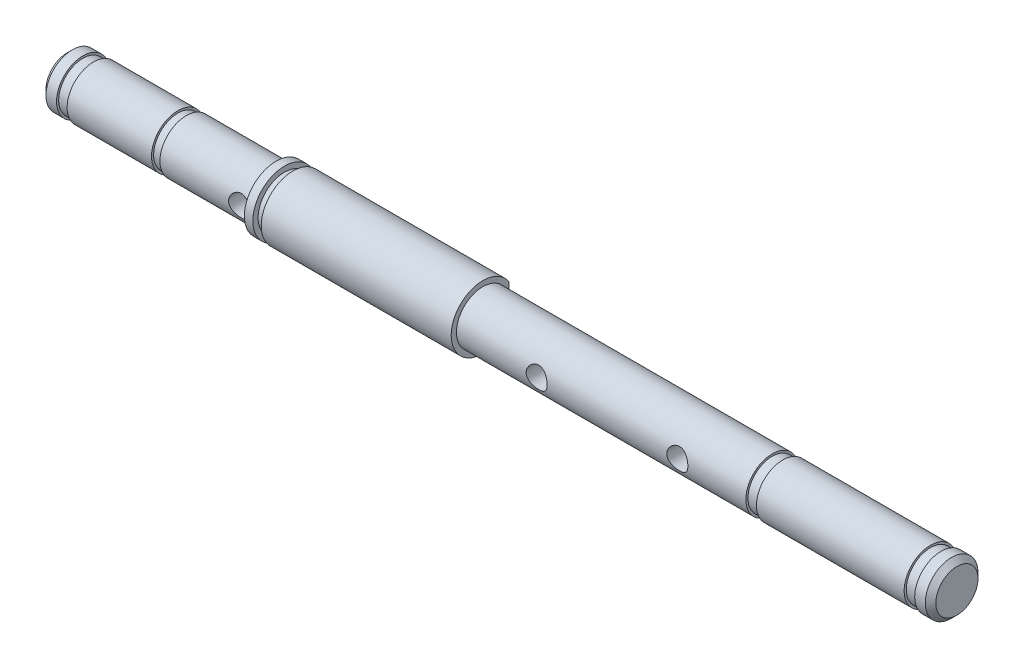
ISO-10303-21;
HEADER;
FILE_DESCRIPTION(('STEP AP214'),'2;1');
FILE_NAME('part.step','',(''),(''),'','','');
FILE_SCHEMA(('AUTOMOTIVE_DESIGN { 1 0 10303 214 1 1 1 1 }'));
ENDSEC;
DATA;
#1=APPLICATION_CONTEXT('core data for automotive mechanical design processes');
#2=APPLICATION_PROTOCOL_DEFINITION('international standard','automotive_design',2000,#1);
#3=PRODUCT_CONTEXT('',#1,'mechanical');
#4=PRODUCT('Part','Part','',(#3));
#5=PRODUCT_RELATED_PRODUCT_CATEGORY('part','',(#4));
#6=PRODUCT_DEFINITION_FORMATION('','',#4);
#7=PRODUCT_DEFINITION_CONTEXT('part definition',#1,'design');
#8=PRODUCT_DEFINITION('design','',#6,#7);
#9=PRODUCT_DEFINITION_SHAPE('','',#8);
#10=(LENGTH_UNIT() NAMED_UNIT(*) SI_UNIT(.MILLI.,.METRE.));
#11=(NAMED_UNIT(*) PLANE_ANGLE_UNIT() SI_UNIT($,.RADIAN.));
#12=(NAMED_UNIT(*) SI_UNIT($,.STERADIAN.) SOLID_ANGLE_UNIT());
#13=UNCERTAINTY_MEASURE_WITH_UNIT(LENGTH_MEASURE(1.E-05),#10,'distance_accuracy_value','');
#14=(GEOMETRIC_REPRESENTATION_CONTEXT(3) GLOBAL_UNCERTAINTY_ASSIGNED_CONTEXT((#13)) GLOBAL_UNIT_ASSIGNED_CONTEXT((#10,
#11,#12)) REPRESENTATION_CONTEXT('',''));
#15=CARTESIAN_POINT('',(0.,0.,0.));
#16=DIRECTION('',(0.,0.,1.));
#17=DIRECTION('',(1.,0.,0.));
#18=AXIS2_PLACEMENT_3D('',#15,#16,#17);
#19=CARTESIAN_POINT('',(39.4,3.,0.));
#20=DIRECTION('',(-1.,0.,0.));
#21=DIRECTION('',(0.,0.,1.));
#22=AXIS2_PLACEMENT_3D('',#19,#20,#21);
#23=PLANE('',#22);
#24=DIRECTION('',(0.,-1.,0.));
#25=VECTOR('',#24,1.);
#26=CARTESIAN_POINT('',(39.4,1.7,-2.5));
#27=LINE('',#26,#25);
#28=CARTESIAN_POINT('',(39.4,1.6583123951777,-2.5));
#29=VERTEX_POINT('',#28);
#30=CARTESIAN_POINT('',(39.4,0.,-2.5));
#31=VERTEX_POINT('',#30);
#32=EDGE_CURVE('E408',#29,#31,#27,.T.);
#33=ORIENTED_EDGE('',*,*,#32,.F.);
#34=CARTESIAN_POINT('',(39.4,0.,0.));
#35=DIRECTION('',(-1.,0.,0.));
#36=DIRECTION('',(0.,0.,1.));
#37=AXIS2_PLACEMENT_3D('',#34,#35,#36);
#38=CIRCLE('',#37,3.);
#39=CARTESIAN_POINT('',(39.4,-1.6583123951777,-2.5));
#40=VERTEX_POINT('',#39);
#41=EDGE_CURVE('E483',#40,#29,#38,.T.);
#42=ORIENTED_EDGE('',*,*,#41,.F.);
#43=EDGE_CURVE('E402',#31,#40,#27,.T.);
#44=ORIENTED_EDGE('',*,*,#43,.F.);
#45=CARTESIAN_POINT('',(39.4,0.,0.));
#46=DIRECTION('',(-1.,0.,0.));
#47=DIRECTION('',(0.,0.,1.));
#48=AXIS2_PLACEMENT_3D('',#45,#46,#47);
#49=CIRCLE('',#48,2.5);
#50=EDGE_CURVE('E473',#31,#31,#49,.T.);
#51=ORIENTED_EDGE('',*,*,#50,.T.);
#52=EDGE_LOOP('',(#33,#42,#44,#51));
#53=FACE_BOUND('',#52,.T.);
#54=ADVANCED_FACE('F362',(#53),#23,.F.);
#55=CARTESIAN_POINT('',(-4.72932200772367,0.,0.));
#56=DIRECTION('',(-1.,0.,0.));
#57=DIRECTION('',(0.,0.,1.));
#58=AXIS2_PLACEMENT_3D('',#55,#56,#57);
#59=CYLINDRICAL_SURFACE('',#58,3.);
#60=CARTESIAN_POINT('',(21.4,0.,0.));
#61=DIRECTION('',(-1.,0.,0.));
#62=DIRECTION('',(0.,0.,1.));
#63=AXIS2_PLACEMENT_3D('',#60,#61,#62);
#64=CIRCLE('',#63,3.);
#65=CARTESIAN_POINT('',(21.4,0.,3.));
#66=VERTEX_POINT('',#65);
#67=EDGE_CURVE('E552',#66,#66,#64,.T.);
#68=ORIENTED_EDGE('',*,*,#67,.F.);
#69=EDGE_LOOP('',(#68));
#70=FACE_BOUND('',#69,.T.);
#71=DIRECTION('',(-1.,0.,0.));
#72=VECTOR('',#71,1.);
#73=CARTESIAN_POINT('',(-4.72932200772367,1.6583123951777,-2.5));
#74=LINE('',#73,#72);
#75=CARTESIAN_POINT('',(33.9,1.6583123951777,-2.5));
#76=VERTEX_POINT('',#75);
#77=EDGE_CURVE('E11',#76,#29,#74,.F.);
#78=ORIENTED_EDGE('',*,*,#77,.F.);
#79=CARTESIAN_POINT('',(33.9,0.,0.));
#80=DIRECTION('',(-1.,0.,0.));
#81=DIRECTION('',(0.,0.,1.));
#82=AXIS2_PLACEMENT_3D('',#79,#80,#81);
#83=CIRCLE('',#82,3.);
#84=CARTESIAN_POINT('',(33.9,-1.6583123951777,-2.5));
#85=VERTEX_POINT('',#84);
#86=EDGE_CURVE('E376',#76,#85,#83,.T.);
#87=ORIENTED_EDGE('',*,*,#86,.T.);
#88=DIRECTION('',(-1.,0.,0.));
#89=VECTOR('',#88,1.);
#90=CARTESIAN_POINT('',(-4.72932200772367,-1.6583123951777,-2.5));
#91=LINE('',#90,#89);
#92=EDGE_CURVE('E370',#40,#85,#91,.T.);
#93=ORIENTED_EDGE('',*,*,#92,.F.);
#94=ORIENTED_EDGE('',*,*,#41,.T.);
#95=EDGE_LOOP('',(#78,#87,#93,#94));
#96=FACE_BOUND('',#95,.T.);
#97=ADVANCED_FACE('F410',(#70,#96),#59,.T.);
#98=CARTESIAN_POINT('',(84.33,0.,0.));
#99=DIRECTION('',(-1.,0.,0.));
#100=DIRECTION('',(0.,0.,1.));
#101=AXIS2_PLACEMENT_3D('',#98,#99,#100);
#102=PLANE('',#101);
#103=CARTESIAN_POINT('',(84.33,0.,0.));
#104=DIRECTION('',(-1.,0.,0.));
#105=DIRECTION('',(0.,0.,1.));
#106=AXIS2_PLACEMENT_3D('',#103,#104,#105);
#107=CIRCLE('',#106,2.);
#108=CARTESIAN_POINT('',(84.33,0.,2.));
#109=VERTEX_POINT('',#108);
#110=EDGE_CURVE('E411',#109,#109,#107,.F.);
#111=ORIENTED_EDGE('',*,*,#110,.T.);
#112=EDGE_LOOP('',(#111));
#113=FACE_BOUND('',#112,.T.);
#114=ADVANCED_FACE('F364',(#113),#102,.F.);
#115=CARTESIAN_POINT('',(-4.72932200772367,0.,0.));
#116=DIRECTION('',(-1.,0.,0.));
#117=DIRECTION('',(0.,0.,1.));
#118=AXIS2_PLACEMENT_3D('',#115,#116,#117);
#119=CYLINDRICAL_SURFACE('',#118,2.5);
#120=CARTESIAN_POINT('',(83.83,0.,0.));
#121=DIRECTION('',(-1.,0.,0.));
#122=DIRECTION('',(0.,0.,1.));
#123=AXIS2_PLACEMENT_3D('',#120,#121,#122);
#124=CIRCLE('',#123,2.5);
#125=CARTESIAN_POINT('',(83.83,0.,2.5));
#126=VERTEX_POINT('',#125);
#127=EDGE_CURVE('E414',#126,#126,#124,.T.);
#128=ORIENTED_EDGE('',*,*,#127,.T.);
#129=EDGE_LOOP('',(#128));
#130=FACE_BOUND('',#129,.T.);
#131=CARTESIAN_POINT('',(82.83,0.,0.));
#132=DIRECTION('',(-1.,0.,0.));
#133=DIRECTION('',(0.,0.,1.));
#134=AXIS2_PLACEMENT_3D('',#131,#132,#133);
#135=CIRCLE('',#134,2.5);
#136=CARTESIAN_POINT('',(82.83,0.,2.5));
#137=VERTEX_POINT('',#136);
#138=EDGE_CURVE('E501',#137,#137,#135,.T.);
#139=ORIENTED_EDGE('',*,*,#138,.F.);
#140=EDGE_LOOP('',(#139));
#141=FACE_BOUND('',#140,.T.);
#142=ADVANCED_FACE('F726',(#130,#141),#119,.T.);
#143=CARTESIAN_POINT('',(82.83,2.5,0.));
#144=DIRECTION('',(1.,0.,0.));
#145=DIRECTION('',(0.,0.,-1.));
#146=AXIS2_PLACEMENT_3D('',#143,#144,#145);
#147=PLANE('',#146);
#148=CARTESIAN_POINT('',(82.83,0.,0.));
#149=DIRECTION('',(-1.,0.,0.));
#150=DIRECTION('',(0.,0.,1.));
#151=AXIS2_PLACEMENT_3D('',#148,#149,#150);
#152=CIRCLE('',#151,2.3);
#153=CARTESIAN_POINT('',(82.83,0.,2.3));
#154=VERTEX_POINT('',#153);
#155=EDGE_CURVE('E498',#154,#154,#152,.T.);
#156=ORIENTED_EDGE('',*,*,#155,.F.);
#157=EDGE_LOOP('',(#156));
#158=FACE_BOUND('',#157,.T.);
#159=ORIENTED_EDGE('',*,*,#138,.T.);
#160=EDGE_LOOP('',(#159));
#161=FACE_BOUND('',#160,.T.);
#162=ADVANCED_FACE('F719',(#158,#161),#147,.F.);
#163=CARTESIAN_POINT('',(-4.72932200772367,0.,0.));
#164=DIRECTION('',(-1.,0.,0.));
#165=DIRECTION('',(0.,0.,1.));
#166=AXIS2_PLACEMENT_3D('',#163,#164,#165);
#167=CYLINDRICAL_SURFACE('',#166,2.3);
#168=CARTESIAN_POINT('',(81.83,0.,0.));
#169=DIRECTION('',(-1.,0.,0.));
#170=DIRECTION('',(0.,0.,1.));
#171=AXIS2_PLACEMENT_3D('',#168,#169,#170);
#172=CIRCLE('',#171,2.3);
#173=CARTESIAN_POINT('',(81.83,0.,2.3));
#174=VERTEX_POINT('',#173);
#175=EDGE_CURVE('E495',#174,#174,#172,.T.);
#176=ORIENTED_EDGE('',*,*,#175,.F.);
#177=EDGE_LOOP('',(#176));
#178=FACE_BOUND('',#177,.T.);
#179=ORIENTED_EDGE('',*,*,#155,.T.);
#180=EDGE_LOOP('',(#179));
#181=FACE_BOUND('',#180,.T.);
#182=ADVANCED_FACE('F711',(#178,#181),#167,.T.);
#183=CARTESIAN_POINT('',(81.83,2.5,0.));
#184=DIRECTION('',(-1.,0.,0.));
#185=DIRECTION('',(0.,0.,1.));
#186=AXIS2_PLACEMENT_3D('',#183,#184,#185);
#187=PLANE('',#186);
#188=CARTESIAN_POINT('',(81.83,0.,0.));
#189=DIRECTION('',(-1.,0.,0.));
#190=DIRECTION('',(0.,0.,1.));
#191=AXIS2_PLACEMENT_3D('',#188,#189,#190);
#192=CIRCLE('',#191,2.5);
#193=CARTESIAN_POINT('',(81.83,0.,2.5));
#194=VERTEX_POINT('',#193);
#195=EDGE_CURVE('E492',#194,#194,#192,.T.);
#196=ORIENTED_EDGE('',*,*,#195,.F.);
#197=EDGE_LOOP('',(#196));
#198=FACE_BOUND('',#197,.T.);
#199=ORIENTED_EDGE('',*,*,#175,.T.);
#200=EDGE_LOOP('',(#199));
#201=FACE_BOUND('',#200,.T.);
#202=ADVANCED_FACE('F703',(#198,#201),#187,.F.);
#203=CARTESIAN_POINT('',(-4.72932200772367,0.,0.));
#204=DIRECTION('',(-1.,0.,0.));
#205=DIRECTION('',(0.,0.,1.));
#206=AXIS2_PLACEMENT_3D('',#203,#204,#205);
#207=CYLINDRICAL_SURFACE('',#206,2.5);
#208=CARTESIAN_POINT('',(67.83,0.,0.));
#209=DIRECTION('',(-1.,0.,0.));
#210=DIRECTION('',(0.,0.,1.));
#211=AXIS2_PLACEMENT_3D('',#208,#209,#210);
#212=CIRCLE('',#211,2.5);
#213=CARTESIAN_POINT('',(67.83,0.,2.5));
#214=VERTEX_POINT('',#213);
#215=EDGE_CURVE('E489',#214,#214,#212,.T.);
#216=ORIENTED_EDGE('',*,*,#215,.F.);
#217=EDGE_LOOP('',(#216));
#218=FACE_BOUND('',#217,.T.);
#219=ORIENTED_EDGE('',*,*,#195,.T.);
#220=EDGE_LOOP('',(#219));
#221=FACE_BOUND('',#220,.T.);
#222=ADVANCED_FACE('F695',(#218,#221),#207,.T.);
#223=CARTESIAN_POINT('',(67.83,2.5,0.));
#224=DIRECTION('',(1.,0.,0.));
#225=DIRECTION('',(0.,0.,-1.));
#226=AXIS2_PLACEMENT_3D('',#223,#224,#225);
#227=PLANE('',#226);
#228=CARTESIAN_POINT('',(67.83,0.,0.));
#229=DIRECTION('',(-1.,0.,0.));
#230=DIRECTION('',(0.,0.,1.));
#231=AXIS2_PLACEMENT_3D('',#228,#229,#230);
#232=CIRCLE('',#231,2.3);
#233=CARTESIAN_POINT('',(67.83,0.,2.3));
#234=VERTEX_POINT('',#233);
#235=EDGE_CURVE('E481',#234,#234,#232,.T.);
#236=ORIENTED_EDGE('',*,*,#235,.F.);
#237=EDGE_LOOP('',(#236));
#238=FACE_BOUND('',#237,.T.);
#239=ORIENTED_EDGE('',*,*,#215,.T.);
#240=EDGE_LOOP('',(#239));
#241=FACE_BOUND('',#240,.T.);
#242=ADVANCED_FACE('F687',(#238,#241),#227,.F.);
#243=CARTESIAN_POINT('',(-4.72932200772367,0.,0.));
#244=DIRECTION('',(-1.,0.,0.));
#245=DIRECTION('',(0.,0.,1.));
#246=AXIS2_PLACEMENT_3D('',#243,#244,#245);
#247=CYLINDRICAL_SURFACE('',#246,2.3);
#248=CARTESIAN_POINT('',(66.83,0.,0.));
#249=DIRECTION('',(-1.,0.,0.));
#250=DIRECTION('',(0.,0.,1.));
#251=AXIS2_PLACEMENT_3D('',#248,#249,#250);
#252=CIRCLE('',#251,2.3);
#253=CARTESIAN_POINT('',(66.83,0.,2.3));
#254=VERTEX_POINT('',#253);
#255=EDGE_CURVE('E478',#254,#254,#252,.T.);
#256=ORIENTED_EDGE('',*,*,#255,.F.);
#257=EDGE_LOOP('',(#256));
#258=FACE_BOUND('',#257,.T.);
#259=ORIENTED_EDGE('',*,*,#235,.T.);
#260=EDGE_LOOP('',(#259));
#261=FACE_BOUND('',#260,.T.);
#262=ADVANCED_FACE('F681',(#258,#261),#247,.T.);
#263=CARTESIAN_POINT('',(66.83,2.5,0.));
#264=DIRECTION('',(-1.,0.,0.));
#265=DIRECTION('',(0.,0.,1.));
#266=AXIS2_PLACEMENT_3D('',#263,#264,#265);
#267=PLANE('',#266);
#268=CARTESIAN_POINT('',(66.83,0.,0.));
#269=DIRECTION('',(-1.,0.,0.));
#270=DIRECTION('',(0.,0.,1.));
#271=AXIS2_PLACEMENT_3D('',#268,#269,#270);
#272=CIRCLE('',#271,2.5);
#273=CARTESIAN_POINT('',(66.83,0.,2.5));
#274=VERTEX_POINT('',#273);
#275=EDGE_CURVE('E476',#274,#274,#272,.T.);
#276=ORIENTED_EDGE('',*,*,#275,.F.);
#277=EDGE_LOOP('',(#276));
#278=FACE_BOUND('',#277,.T.);
#279=ORIENTED_EDGE('',*,*,#255,.T.);
#280=EDGE_LOOP('',(#279));
#281=FACE_BOUND('',#280,.T.);
#282=ADVANCED_FACE('F468',(#278,#281),#267,.F.);
#283=CARTESIAN_POINT('',(-4.72932200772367,0.,0.));
#284=DIRECTION('',(-1.,0.,0.));
#285=DIRECTION('',(0.,0.,1.));
#286=AXIS2_PLACEMENT_3D('',#283,#284,#285);
#287=CYLINDRICAL_SURFACE('',#286,2.5);
#288=CARTESIAN_POINT('',(61.33,0.,2.5));
#289=CARTESIAN_POINT('',(61.3299950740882,-0.053746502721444,2.49999635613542));
#290=CARTESIAN_POINT('',(61.3256411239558,-0.107586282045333,2.49824647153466));
#291=CARTESIAN_POINT('',(61.3083761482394,-0.213748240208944,2.49141726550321));
#292=CARTESIAN_POINT('',(61.2954418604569,-0.266065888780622,2.48632889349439));
#293=CARTESIAN_POINT('',(61.2615619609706,-0.367476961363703,2.47337104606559));
#294=CARTESIAN_POINT('',(61.2406425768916,-0.416580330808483,2.46551068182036));
#295=CARTESIAN_POINT('',(61.1914904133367,-0.510535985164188,2.44778305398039));
#296=CARTESIAN_POINT('',(61.1632601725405,-0.555389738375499,2.43791648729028));
#297=CARTESIAN_POINT('',(61.0988822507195,-0.641750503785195,2.41665443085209));
#298=CARTESIAN_POINT('',(61.0624466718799,-0.683031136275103,2.40521148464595));
#299=CARTESIAN_POINT('',(60.9832999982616,-0.759087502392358,2.38230288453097));
#300=CARTESIAN_POINT('',(60.9405858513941,-0.793860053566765,2.37083722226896));
#301=CARTESIAN_POINT('',(60.8477859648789,-0.857437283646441,2.34861395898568));
#302=CARTESIAN_POINT('',(60.7974567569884,-0.88590749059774,2.33791057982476));
#303=CARTESIAN_POINT('',(60.69223180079,-0.933877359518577,2.31916823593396));
#304=CARTESIAN_POINT('',(60.6373382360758,-0.953381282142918,2.31112800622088));
#305=CARTESIAN_POINT('',(60.5271438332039,-0.981949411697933,2.29913178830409));
#306=CARTESIAN_POINT('',(60.4719743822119,-0.991446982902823,2.29500710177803));
#307=CARTESIAN_POINT('',(60.3606825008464,-1.00108648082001,2.29082002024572));
#308=CARTESIAN_POINT('',(60.3045605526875,-1.00123300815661,2.29075562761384));
#309=CARTESIAN_POINT('',(60.197121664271,-0.99249468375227,2.29455250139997));
#310=CARTESIAN_POINT('',(60.1457421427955,-0.984237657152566,2.29814087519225));
#311=CARTESIAN_POINT('',(60.0451702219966,-0.959973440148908,2.30838093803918));
#312=CARTESIAN_POINT('',(59.9959782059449,-0.943964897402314,2.31503316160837));
#313=CARTESIAN_POINT('',(59.899991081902,-0.904347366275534,2.33079742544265));
#314=CARTESIAN_POINT('',(59.8532653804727,-0.880589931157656,2.33995689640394));
#315=CARTESIAN_POINT('',(59.7642920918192,-0.826253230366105,2.35969058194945));
#316=CARTESIAN_POINT('',(59.7220461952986,-0.795671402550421,2.37026532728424));
#317=CARTESIAN_POINT('',(59.639795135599,-0.725775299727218,2.39263368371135));
#318=CARTESIAN_POINT('',(59.600215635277,-0.685968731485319,2.40445832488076));
#319=CARTESIAN_POINT('',(59.528157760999,-0.600157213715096,2.42729912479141));
#320=CARTESIAN_POINT('',(59.4956808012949,-0.554151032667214,2.43831512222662));
#321=CARTESIAN_POINT('',(59.4381912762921,-0.456038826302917,2.45857340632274));
#322=CARTESIAN_POINT('',(59.4133388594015,-0.403830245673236,2.46777635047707));
#323=CARTESIAN_POINT('',(59.372916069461,-0.29551188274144,2.48307414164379));
#324=CARTESIAN_POINT('',(59.3573409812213,-0.239404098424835,2.48917056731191));
#325=CARTESIAN_POINT('',(59.3367758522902,-0.128447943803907,2.49728069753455));
#326=CARTESIAN_POINT('',(59.3312137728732,-0.0737216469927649,2.49951472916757));
#327=CARTESIAN_POINT('',(59.3291434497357,0.0359226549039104,2.50034239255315));
#328=CARTESIAN_POINT('',(59.3326328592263,0.0908406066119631,2.49893696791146));
#329=CARTESIAN_POINT('',(59.348145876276,0.196716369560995,2.49278783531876));
#330=CARTESIAN_POINT('',(59.3597789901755,0.247741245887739,2.48819695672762));
#331=CARTESIAN_POINT('',(59.3907178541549,0.347067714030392,2.4762972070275));
#332=CARTESIAN_POINT('',(59.4100245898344,0.395368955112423,2.46898798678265));
#333=CARTESIAN_POINT('',(59.45639246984,0.489539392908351,2.45208297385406));
#334=CARTESIAN_POINT('',(59.4836727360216,0.535289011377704,2.44242407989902));
#335=CARTESIAN_POINT('',(59.5449701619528,0.621721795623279,2.42186682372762));
#336=CARTESIAN_POINT('',(59.5789900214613,0.662402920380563,2.41096796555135));
#337=CARTESIAN_POINT('',(59.6554350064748,0.74036152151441,2.38822558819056));
#338=CARTESIAN_POINT('',(59.6982667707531,0.777236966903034,2.37636720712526));
#339=CARTESIAN_POINT('',(59.7897200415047,0.843375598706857,2.35370836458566));
#340=CARTESIAN_POINT('',(59.83834250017,0.872637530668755,2.34290807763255));
#341=CARTESIAN_POINT('',(59.9407308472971,0.922903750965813,2.32357149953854));
#342=CARTESIAN_POINT('',(59.9945419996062,0.943825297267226,2.31505815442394));
#343=CARTESIAN_POINT('',(60.1053668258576,0.97614810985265,2.30161836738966));
#344=CARTESIAN_POINT('',(60.1623781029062,0.987556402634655,2.29668927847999));
#345=CARTESIAN_POINT('',(60.2735639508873,0.999857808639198,2.29135879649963));
#346=CARTESIAN_POINT('',(60.3276474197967,1.00144854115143,2.29065710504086));
#347=CARTESIAN_POINT('',(60.4352724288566,0.995901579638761,2.29307418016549));
#348=CARTESIAN_POINT('',(60.4888140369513,0.98876499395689,2.29619246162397));
#349=CARTESIAN_POINT('',(60.5916660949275,0.966535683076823,2.3056332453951));
#350=CARTESIAN_POINT('',(60.6410601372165,0.951768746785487,2.31182415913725));
#351=CARTESIAN_POINT('',(60.7366893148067,0.915002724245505,2.32662000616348));
#352=CARTESIAN_POINT('',(60.7829235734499,0.893001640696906,2.33522560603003));
#353=CARTESIAN_POINT('',(60.8738048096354,0.840936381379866,2.35449304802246));
#354=CARTESIAN_POINT('',(60.9182093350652,0.810482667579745,2.36524441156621));
#355=CARTESIAN_POINT('',(61.0014966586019,0.742946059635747,2.38731902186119));
#356=CARTESIAN_POINT('',(61.0403777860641,0.70586116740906,2.39864244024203));
#357=CARTESIAN_POINT('',(61.1141014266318,0.62325275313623,2.42146783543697));
#358=CARTESIAN_POINT('',(61.148518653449,0.577338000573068,2.43293378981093));
#359=CARTESIAN_POINT('',(61.2091685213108,0.479950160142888,2.45400203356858));
#360=CARTESIAN_POINT('',(61.2353973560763,0.428474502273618,2.46360345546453));
#361=CARTESIAN_POINT('',(61.2783111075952,0.322369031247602,2.47969857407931));
#362=CARTESIAN_POINT('',(61.2951646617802,0.267815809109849,2.48624681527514));
#363=CARTESIAN_POINT('',(61.3193195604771,0.156438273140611,2.49572153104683));
#364=CARTESIAN_POINT('',(61.3266512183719,0.0996217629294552,2.49865949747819));
#365=CARTESIAN_POINT('',(61.3296976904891,0.0284561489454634,2.49987949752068));
#366=CARTESIAN_POINT('',(61.3300013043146,0.0142313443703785,2.50000096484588));
#367=CARTESIAN_POINT('',(61.33,0.,2.5));
#368=B_SPLINE_CURVE_WITH_KNOTS('',3,(#288,#289,#290,#291,#292,#293,#294,#295,#296,#297,#298,
#299,#300,#301,#302,#303,#304,#305,#306,#307,#308,#309,#310,#311,#312,#313,#314,#315,#316,#317,
#318,#319,#320,#321,#322,#323,#324,#325,#326,#327,#328,#329,#330,#331,#332,#333,#334,#335,#336,
#337,#338,#339,#340,#341,#342,#343,#344,#345,#346,#347,#348,#349,#350,#351,#352,#353,#354,#355,
#356,#357,#358,#359,#360,#361,#362,#363,#364,#365,#366,#367),.UNSPECIFIED.,.T.,.F.,(4,2,2,2,2,2,
2,2,2,2,2,2,2,2,2,2,2,2,2,2,2,2,2,2,2,2,2,2,2,2,2,2,2,2,2,2,2,2,2,4),(0.,0.161201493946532,
0.322841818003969,0.483955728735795,0.645013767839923,0.812986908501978,0.981041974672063,
1.1565762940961,1.33202711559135,1.49952052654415,1.66693153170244,1.82269164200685,
1.97847893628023,2.13744563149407,2.29647210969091,2.46779174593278,2.63914546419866,
2.81388456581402,2.98853478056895,3.15284592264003,3.31711446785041,3.47400227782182,
3.63091024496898,3.79261756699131,3.95438979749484,4.12684237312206,4.29932334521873,
4.47347522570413,4.64749836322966,4.80899836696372,4.97047786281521,5.12557159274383,
5.28070817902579,5.44472734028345,5.60879600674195,5.78350211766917,5.95828931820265,
6.12982150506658,6.3008062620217,6.34349022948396),.UNSPECIFIED.);
#369=CARTESIAN_POINT('',(61.33,0.,2.5));
#370=VERTEX_POINT('',#369);
#371=EDGE_CURVE('E417',#370,#370,#368,.T.);
#372=ORIENTED_EDGE('',*,*,#371,.T.);
#373=EDGE_LOOP('',(#372));
#374=FACE_BOUND('',#373,.T.);
#375=CARTESIAN_POINT('',(61.33,0.,-2.5));
#376=CARTESIAN_POINT('',(61.3299950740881,0.0537465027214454,-2.49999635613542));
#377=CARTESIAN_POINT('',(61.3256411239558,0.107586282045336,-2.49824647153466));
#378=CARTESIAN_POINT('',(61.3083761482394,0.213748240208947,-2.49141726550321));
#379=CARTESIAN_POINT('',(61.2954418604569,0.266065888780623,-2.48632889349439));
#380=CARTESIAN_POINT('',(61.2615619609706,0.367476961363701,-2.47337104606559));
#381=CARTESIAN_POINT('',(61.2406425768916,0.41658033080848,-2.46551068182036));
#382=CARTESIAN_POINT('',(61.1914904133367,0.510535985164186,-2.44778305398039));
#383=CARTESIAN_POINT('',(61.1632601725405,0.555389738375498,-2.43791648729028));
#384=CARTESIAN_POINT('',(61.0988822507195,0.641750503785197,-2.41665443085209));
#385=CARTESIAN_POINT('',(61.0624466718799,0.683031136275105,-2.40521148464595));
#386=CARTESIAN_POINT('',(60.9832999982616,0.759087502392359,-2.38230288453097));
#387=CARTESIAN_POINT('',(60.9405858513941,0.793860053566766,-2.37083722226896));
#388=CARTESIAN_POINT('',(60.8477859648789,0.857437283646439,-2.34861395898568));
#389=CARTESIAN_POINT('',(60.7974567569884,0.885907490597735,-2.33791057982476));
#390=CARTESIAN_POINT('',(60.69223180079,0.933877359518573,-2.31916823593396));
#391=CARTESIAN_POINT('',(60.6373382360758,0.953381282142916,-2.31112800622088));
#392=CARTESIAN_POINT('',(60.527143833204,0.981949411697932,-2.29913178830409));
#393=CARTESIAN_POINT('',(60.4719743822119,0.991446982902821,-2.29500710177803));
#394=CARTESIAN_POINT('',(60.3606825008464,1.00108648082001,-2.29082002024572));
#395=CARTESIAN_POINT('',(60.3045605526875,1.00123300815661,-2.29075562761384));
#396=CARTESIAN_POINT('',(60.197121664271,0.99249468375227,-2.29455250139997));
#397=CARTESIAN_POINT('',(60.1457421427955,0.984237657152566,-2.29814087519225));
#398=CARTESIAN_POINT('',(60.0451702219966,0.959973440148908,-2.30838093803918));
#399=CARTESIAN_POINT('',(59.9959782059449,0.943964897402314,-2.31503316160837));
#400=CARTESIAN_POINT('',(59.899991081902,0.904347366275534,-2.33079742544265));
#401=CARTESIAN_POINT('',(59.8532653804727,0.880589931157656,-2.33995689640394));
#402=CARTESIAN_POINT('',(59.7642920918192,0.826253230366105,-2.35969058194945));
#403=CARTESIAN_POINT('',(59.7220461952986,0.795671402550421,-2.37026532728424));
#404=CARTESIAN_POINT('',(59.639795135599,0.725775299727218,-2.39263368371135));
#405=CARTESIAN_POINT('',(59.600215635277,0.685968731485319,-2.40445832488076));
#406=CARTESIAN_POINT('',(59.528157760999,0.600157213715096,-2.42729912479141));
#407=CARTESIAN_POINT('',(59.4956808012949,0.554151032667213,-2.43831512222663));
#408=CARTESIAN_POINT('',(59.4381912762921,0.456038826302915,-2.45857340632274));
#409=CARTESIAN_POINT('',(59.4133388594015,0.403830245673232,-2.46777635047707));
#410=CARTESIAN_POINT('',(59.372916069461,0.295511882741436,-2.48307414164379));
#411=CARTESIAN_POINT('',(59.3573409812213,0.239404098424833,-2.48917056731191));
#412=CARTESIAN_POINT('',(59.3367758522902,0.128447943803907,-2.49728069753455));
#413=CARTESIAN_POINT('',(59.3312137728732,0.0737216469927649,-2.49951472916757));
#414=CARTESIAN_POINT('',(59.3291434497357,-0.0359226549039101,-2.50034239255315));
#415=CARTESIAN_POINT('',(59.3326328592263,-0.0908406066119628,-2.49893696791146));
#416=CARTESIAN_POINT('',(59.348145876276,-0.196716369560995,-2.49278783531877));
#417=CARTESIAN_POINT('',(59.3597789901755,-0.247741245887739,-2.48819695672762));
#418=CARTESIAN_POINT('',(59.3907178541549,-0.347067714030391,-2.4762972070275));
#419=CARTESIAN_POINT('',(59.4100245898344,-0.395368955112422,-2.46898798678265));
#420=CARTESIAN_POINT('',(59.45639246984,-0.489539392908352,-2.45208297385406));
#421=CARTESIAN_POINT('',(59.4836727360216,-0.535289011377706,-2.44242407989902));
#422=CARTESIAN_POINT('',(59.5449701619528,-0.621721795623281,-2.42186682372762));
#423=CARTESIAN_POINT('',(59.5789900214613,-0.662402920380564,-2.41096796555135));
#424=CARTESIAN_POINT('',(59.6554350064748,-0.740361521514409,-2.38822558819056));
#425=CARTESIAN_POINT('',(59.6982667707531,-0.777236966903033,-2.37636720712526));
#426=CARTESIAN_POINT('',(59.7897200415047,-0.843375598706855,-2.35370836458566));
#427=CARTESIAN_POINT('',(59.83834250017,-0.872637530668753,-2.34290807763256));
#428=CARTESIAN_POINT('',(59.940730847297,-0.922903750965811,-2.32357149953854));
#429=CARTESIAN_POINT('',(59.9945419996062,-0.943825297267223,-2.31505815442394));
#430=CARTESIAN_POINT('',(60.1053668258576,-0.976148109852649,-2.30161836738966));
#431=CARTESIAN_POINT('',(60.1623781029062,-0.987556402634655,-2.29668927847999));
#432=CARTESIAN_POINT('',(60.2735639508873,-0.999857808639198,-2.29135879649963));
#433=CARTESIAN_POINT('',(60.3276474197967,-1.00144854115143,-2.29065710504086));
#434=CARTESIAN_POINT('',(60.4352724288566,-0.995901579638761,-2.29307418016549));
#435=CARTESIAN_POINT('',(60.4888140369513,-0.98876499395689,-2.29619246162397));
#436=CARTESIAN_POINT('',(60.5916660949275,-0.966535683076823,-2.3056332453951));
#437=CARTESIAN_POINT('',(60.6410601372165,-0.951768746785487,-2.31182415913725));
#438=CARTESIAN_POINT('',(60.7366893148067,-0.915002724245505,-2.32662000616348));
#439=CARTESIAN_POINT('',(60.7829235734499,-0.893001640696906,-2.33522560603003));
#440=CARTESIAN_POINT('',(60.8738048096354,-0.840936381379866,-2.35449304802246));
#441=CARTESIAN_POINT('',(60.9182093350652,-0.810482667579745,-2.36524441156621));
#442=CARTESIAN_POINT('',(61.0014966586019,-0.742946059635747,-2.38731902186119));
#443=CARTESIAN_POINT('',(61.0403777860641,-0.70586116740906,-2.39864244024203));
#444=CARTESIAN_POINT('',(61.1141014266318,-0.62325275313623,-2.42146783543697));
#445=CARTESIAN_POINT('',(61.148518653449,-0.577338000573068,-2.43293378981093));
#446=CARTESIAN_POINT('',(61.2091685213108,-0.479950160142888,-2.45400203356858));
#447=CARTESIAN_POINT('',(61.2353973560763,-0.428474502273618,-2.46360345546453));
#448=CARTESIAN_POINT('',(61.2783111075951,-0.322369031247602,-2.47969857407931));
#449=CARTESIAN_POINT('',(61.2951646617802,-0.267815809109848,-2.48624681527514));
#450=CARTESIAN_POINT('',(61.3193195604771,-0.15643827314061,-2.49572153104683));
#451=CARTESIAN_POINT('',(61.3266512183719,-0.099621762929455,-2.49865949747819));
#452=CARTESIAN_POINT('',(61.3296976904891,-0.0284561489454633,-2.49987949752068));
#453=CARTESIAN_POINT('',(61.3300013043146,-0.0142313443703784,-2.50000096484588));
#454=CARTESIAN_POINT('',(61.33,0.,-2.5));
#455=B_SPLINE_CURVE_WITH_KNOTS('',3,(#375,#376,#377,#378,#379,#380,#381,#382,#383,#384,#385,
#386,#387,#388,#389,#390,#391,#392,#393,#394,#395,#396,#397,#398,#399,#400,#401,#402,#403,#404,
#405,#406,#407,#408,#409,#410,#411,#412,#413,#414,#415,#416,#417,#418,#419,#420,#421,#422,#423,
#424,#425,#426,#427,#428,#429,#430,#431,#432,#433,#434,#435,#436,#437,#438,#439,#440,#441,#442,
#443,#444,#445,#446,#447,#448,#449,#450,#451,#452,#453,#454),.UNSPECIFIED.,.T.,.F.,(4,2,2,2,2,2,
2,2,2,2,2,2,2,2,2,2,2,2,2,2,2,2,2,2,2,2,2,2,2,2,2,2,2,2,2,2,2,2,2,4),(0.,0.161201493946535,
0.322841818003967,0.483955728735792,0.645013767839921,0.812986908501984,0.981041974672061,
1.15657629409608,1.33202711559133,1.49952052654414,1.66693153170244,1.82269164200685,
1.97847893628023,2.13744563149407,2.29647210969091,2.46779174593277,2.63914546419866,
2.81388456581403,2.98853478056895,3.15284592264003,3.3171144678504,3.47400227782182,
3.63091024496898,3.79261756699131,3.95438979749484,4.12684237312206,4.29932334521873,
4.47347522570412,4.64749836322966,4.80899836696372,4.97047786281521,5.12557159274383,
5.28070817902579,5.44472734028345,5.60879600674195,5.78350211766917,5.95828931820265,
6.12982150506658,6.3008062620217,6.34349022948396),.UNSPECIFIED.);
#456=CARTESIAN_POINT('',(61.33,0.,-2.5));
#457=VERTEX_POINT('',#456);
#458=EDGE_CURVE('E407',#457,#457,#455,.T.);
#459=ORIENTED_EDGE('',*,*,#458,.T.);
#460=EDGE_LOOP('',(#459));
#461=FACE_BOUND('',#460,.T.);
#462=CARTESIAN_POINT('',(48.,0.,2.5));
#463=CARTESIAN_POINT('',(47.9999950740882,-0.053746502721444,2.49999635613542));
#464=CARTESIAN_POINT('',(47.9956411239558,-0.107586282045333,2.49824647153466));
#465=CARTESIAN_POINT('',(47.9783761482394,-0.213748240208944,2.49141726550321));
#466=CARTESIAN_POINT('',(47.9654418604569,-0.266065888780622,2.48632889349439));
#467=CARTESIAN_POINT('',(47.9315619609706,-0.367476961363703,2.47337104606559));
#468=CARTESIAN_POINT('',(47.9106425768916,-0.416580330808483,2.46551068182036));
#469=CARTESIAN_POINT('',(47.8614904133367,-0.510535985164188,2.44778305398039));
#470=CARTESIAN_POINT('',(47.8332601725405,-0.555389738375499,2.43791648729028));
#471=CARTESIAN_POINT('',(47.7688822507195,-0.641750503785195,2.41665443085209));
#472=CARTESIAN_POINT('',(47.7324466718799,-0.683031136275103,2.40521148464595));
#473=CARTESIAN_POINT('',(47.6532999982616,-0.759087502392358,2.38230288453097));
#474=CARTESIAN_POINT('',(47.6105858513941,-0.793860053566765,2.37083722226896));
#475=CARTESIAN_POINT('',(47.5177859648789,-0.857437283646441,2.34861395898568));
#476=CARTESIAN_POINT('',(47.4674567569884,-0.88590749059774,2.33791057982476));
#477=CARTESIAN_POINT('',(47.36223180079,-0.933877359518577,2.31916823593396));
#478=CARTESIAN_POINT('',(47.3073382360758,-0.953381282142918,2.31112800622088));
#479=CARTESIAN_POINT('',(47.1971438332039,-0.981949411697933,2.29913178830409));
#480=CARTESIAN_POINT('',(47.1419743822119,-0.991446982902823,2.29500710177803));
#481=CARTESIAN_POINT('',(47.0306825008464,-1.00108648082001,2.29082002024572));
#482=CARTESIAN_POINT('',(46.9745605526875,-1.00123300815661,2.29075562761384));
#483=CARTESIAN_POINT('',(46.867121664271,-0.99249468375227,2.29455250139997));
#484=CARTESIAN_POINT('',(46.8157421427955,-0.984237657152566,2.29814087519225));
#485=CARTESIAN_POINT('',(46.7151702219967,-0.959973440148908,2.30838093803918));
#486=CARTESIAN_POINT('',(46.6659782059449,-0.943964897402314,2.31503316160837));
#487=CARTESIAN_POINT('',(46.569991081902,-0.904347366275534,2.33079742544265));
#488=CARTESIAN_POINT('',(46.5232653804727,-0.880589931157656,2.33995689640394));
#489=CARTESIAN_POINT('',(46.4342920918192,-0.826253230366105,2.35969058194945));
#490=CARTESIAN_POINT('',(46.3920461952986,-0.795671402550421,2.37026532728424));
#491=CARTESIAN_POINT('',(46.309795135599,-0.725775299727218,2.39263368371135));
#492=CARTESIAN_POINT('',(46.270215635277,-0.685968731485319,2.40445832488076));
#493=CARTESIAN_POINT('',(46.198157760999,-0.600157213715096,2.42729912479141));
#494=CARTESIAN_POINT('',(46.1656808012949,-0.554151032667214,2.43831512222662));
#495=CARTESIAN_POINT('',(46.1081912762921,-0.456038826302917,2.45857340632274));
#496=CARTESIAN_POINT('',(46.0833388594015,-0.403830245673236,2.46777635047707));
#497=CARTESIAN_POINT('',(46.042916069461,-0.29551188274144,2.48307414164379));
#498=CARTESIAN_POINT('',(46.0273409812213,-0.239404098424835,2.48917056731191));
#499=CARTESIAN_POINT('',(46.0067758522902,-0.128447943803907,2.49728069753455));
#500=CARTESIAN_POINT('',(46.0012137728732,-0.0737216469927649,2.49951472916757));
#501=CARTESIAN_POINT('',(45.9991434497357,0.0359226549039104,2.50034239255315));
#502=CARTESIAN_POINT('',(46.0026328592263,0.0908406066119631,2.49893696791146));
#503=CARTESIAN_POINT('',(46.018145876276,0.196716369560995,2.49278783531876));
#504=CARTESIAN_POINT('',(46.0297789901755,0.247741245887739,2.48819695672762));
#505=CARTESIAN_POINT('',(46.0607178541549,0.347067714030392,2.4762972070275));
#506=CARTESIAN_POINT('',(46.0800245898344,0.395368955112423,2.46898798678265));
#507=CARTESIAN_POINT('',(46.12639246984,0.489539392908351,2.45208297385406));
#508=CARTESIAN_POINT('',(46.1536727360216,0.535289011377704,2.44242407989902));
#509=CARTESIAN_POINT('',(46.2149701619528,0.621721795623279,2.42186682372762));
#510=CARTESIAN_POINT('',(46.2489900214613,0.662402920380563,2.41096796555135));
#511=CARTESIAN_POINT('',(46.3254350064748,0.740361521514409,2.38822558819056));
#512=CARTESIAN_POINT('',(46.3682667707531,0.777236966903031,2.37636720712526));
#513=CARTESIAN_POINT('',(46.4597200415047,0.843375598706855,2.35370836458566));
#514=CARTESIAN_POINT('',(46.50834250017,0.872637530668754,2.34290807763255));
#515=CARTESIAN_POINT('',(46.6107308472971,0.922903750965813,2.32357149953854));
#516=CARTESIAN_POINT('',(46.6645419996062,0.943825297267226,2.31505815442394));
#517=CARTESIAN_POINT('',(46.7753668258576,0.97614810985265,2.30161836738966));
#518=CARTESIAN_POINT('',(46.8323781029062,0.987556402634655,2.29668927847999));
#519=CARTESIAN_POINT('',(46.9435639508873,0.999857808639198,2.29135879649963));
#520=CARTESIAN_POINT('',(46.9976474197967,1.00144854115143,2.29065710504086));
#521=CARTESIAN_POINT('',(47.1052724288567,0.99590157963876,2.29307418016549));
#522=CARTESIAN_POINT('',(47.1588140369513,0.988764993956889,2.29619246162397));
#523=CARTESIAN_POINT('',(47.2616660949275,0.966535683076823,2.3056332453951));
#524=CARTESIAN_POINT('',(47.3110601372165,0.951768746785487,2.31182415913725));
#525=CARTESIAN_POINT('',(47.4066893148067,0.915002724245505,2.32662000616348));
#526=CARTESIAN_POINT('',(47.4529235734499,0.893001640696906,2.33522560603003));
#527=CARTESIAN_POINT('',(47.5438048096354,0.840936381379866,2.35449304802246));
#528=CARTESIAN_POINT('',(47.5882093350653,0.810482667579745,2.36524441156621));
#529=CARTESIAN_POINT('',(47.6714966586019,0.742946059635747,2.38731902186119));
#530=CARTESIAN_POINT('',(47.7103777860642,0.70586116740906,2.39864244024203));
#531=CARTESIAN_POINT('',(47.7841014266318,0.62325275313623,2.42146783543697));
#532=CARTESIAN_POINT('',(47.818518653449,0.577338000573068,2.43293378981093));
#533=CARTESIAN_POINT('',(47.8791685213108,0.479950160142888,2.45400203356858));
#534=CARTESIAN_POINT('',(47.9053973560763,0.428474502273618,2.46360345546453));
#535=CARTESIAN_POINT('',(47.9483111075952,0.322369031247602,2.47969857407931));
#536=CARTESIAN_POINT('',(47.9651646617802,0.26781580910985,2.48624681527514));
#537=CARTESIAN_POINT('',(47.9893195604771,0.156438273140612,2.49572153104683));
#538=CARTESIAN_POINT('',(47.9966512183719,0.0996217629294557,2.49865949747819));
#539=CARTESIAN_POINT('',(47.9996976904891,0.0284561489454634,2.49987949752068));
#540=CARTESIAN_POINT('',(48.0000013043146,0.0142313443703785,2.50000096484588));
#541=CARTESIAN_POINT('',(48.,0.,2.5));
#542=B_SPLINE_CURVE_WITH_KNOTS('',3,(#462,#463,#464,#465,#466,#467,#468,#469,#470,#471,#472,
#473,#474,#475,#476,#477,#478,#479,#480,#481,#482,#483,#484,#485,#486,#487,#488,#489,#490,#491,
#492,#493,#494,#495,#496,#497,#498,#499,#500,#501,#502,#503,#504,#505,#506,#507,#508,#509,#510,
#511,#512,#513,#514,#515,#516,#517,#518,#519,#520,#521,#522,#523,#524,#525,#526,#527,#528,#529,
#530,#531,#532,#533,#534,#535,#536,#537,#538,#539,#540,#541),.UNSPECIFIED.,.T.,.F.,(4,2,2,2,2,2,
2,2,2,2,2,2,2,2,2,2,2,2,2,2,2,2,2,2,2,2,2,2,2,2,2,2,2,2,2,2,2,2,2,4),(0.,0.161201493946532,
0.322841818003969,0.483955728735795,0.645013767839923,0.812986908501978,0.981041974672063,
1.1565762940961,1.33202711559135,1.49952052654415,1.66693153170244,1.82269164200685,
1.97847893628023,2.13744563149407,2.29647210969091,2.46779174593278,2.63914546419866,
2.81388456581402,2.98853478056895,3.15284592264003,3.31711446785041,3.47400227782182,
3.63091024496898,3.79261756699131,3.95438979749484,4.12684237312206,4.29932334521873,
4.47347522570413,4.64749836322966,4.80899836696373,4.97047786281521,5.12557159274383,
5.28070817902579,5.44472734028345,5.60879600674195,5.78350211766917,5.95828931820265,
6.12982150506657,6.3008062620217,6.34349022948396),.UNSPECIFIED.);
#543=CARTESIAN_POINT('',(48.,0.,2.5));
#544=VERTEX_POINT('',#543);
#545=EDGE_CURVE('E453',#544,#544,#542,.T.);
#546=ORIENTED_EDGE('',*,*,#545,.T.);
#547=EDGE_LOOP('',(#546));
#548=FACE_BOUND('',#547,.T.);
#549=CARTESIAN_POINT('',(48.,0.,-2.5));
#550=CARTESIAN_POINT('',(47.9999950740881,0.0537465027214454,-2.49999635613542));
#551=CARTESIAN_POINT('',(47.9956411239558,0.107586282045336,-2.49824647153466));
#552=CARTESIAN_POINT('',(47.9783761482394,0.213748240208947,-2.49141726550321));
#553=CARTESIAN_POINT('',(47.9654418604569,0.266065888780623,-2.48632889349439));
#554=CARTESIAN_POINT('',(47.9315619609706,0.367476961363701,-2.47337104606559));
#555=CARTESIAN_POINT('',(47.9106425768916,0.41658033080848,-2.46551068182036));
#556=CARTESIAN_POINT('',(47.8614904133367,0.510535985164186,-2.44778305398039));
#557=CARTESIAN_POINT('',(47.8332601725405,0.555389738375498,-2.43791648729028));
#558=CARTESIAN_POINT('',(47.7688822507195,0.641750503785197,-2.41665443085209));
#559=CARTESIAN_POINT('',(47.7324466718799,0.683031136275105,-2.40521148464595));
#560=CARTESIAN_POINT('',(47.6532999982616,0.759087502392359,-2.38230288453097));
#561=CARTESIAN_POINT('',(47.6105858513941,0.793860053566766,-2.37083722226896));
#562=CARTESIAN_POINT('',(47.5177859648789,0.857437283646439,-2.34861395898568));
#563=CARTESIAN_POINT('',(47.4674567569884,0.885907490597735,-2.33791057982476));
#564=CARTESIAN_POINT('',(47.36223180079,0.933877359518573,-2.31916823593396));
#565=CARTESIAN_POINT('',(47.3073382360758,0.953381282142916,-2.31112800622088));
#566=CARTESIAN_POINT('',(47.197143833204,0.981949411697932,-2.29913178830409));
#567=CARTESIAN_POINT('',(47.1419743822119,0.991446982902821,-2.29500710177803));
#568=CARTESIAN_POINT('',(47.0306825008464,1.00108648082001,-2.29082002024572));
#569=CARTESIAN_POINT('',(46.9745605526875,1.00123300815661,-2.29075562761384));
#570=CARTESIAN_POINT('',(46.867121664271,0.99249468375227,-2.29455250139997));
#571=CARTESIAN_POINT('',(46.8157421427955,0.984237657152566,-2.29814087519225));
#572=CARTESIAN_POINT('',(46.7151702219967,0.959973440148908,-2.30838093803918));
#573=CARTESIAN_POINT('',(46.6659782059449,0.943964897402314,-2.31503316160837));
#574=CARTESIAN_POINT('',(46.569991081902,0.904347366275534,-2.33079742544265));
#575=CARTESIAN_POINT('',(46.5232653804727,0.880589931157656,-2.33995689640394));
#576=CARTESIAN_POINT('',(46.4342920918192,0.826253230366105,-2.35969058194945));
#577=CARTESIAN_POINT('',(46.3920461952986,0.795671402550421,-2.37026532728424));
#578=CARTESIAN_POINT('',(46.309795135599,0.725775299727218,-2.39263368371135));
#579=CARTESIAN_POINT('',(46.270215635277,0.685968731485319,-2.40445832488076));
#580=CARTESIAN_POINT('',(46.198157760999,0.600157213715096,-2.42729912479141));
#581=CARTESIAN_POINT('',(46.1656808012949,0.554151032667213,-2.43831512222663));
#582=CARTESIAN_POINT('',(46.1081912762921,0.456038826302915,-2.45857340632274));
#583=CARTESIAN_POINT('',(46.0833388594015,0.403830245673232,-2.46777635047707));
#584=CARTESIAN_POINT('',(46.042916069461,0.295511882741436,-2.48307414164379));
#585=CARTESIAN_POINT('',(46.0273409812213,0.239404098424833,-2.48917056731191));
#586=CARTESIAN_POINT('',(46.0067758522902,0.128447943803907,-2.49728069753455));
#587=CARTESIAN_POINT('',(46.0012137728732,0.0737216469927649,-2.49951472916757));
#588=CARTESIAN_POINT('',(45.9991434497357,-0.0359226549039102,-2.50034239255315));
#589=CARTESIAN_POINT('',(46.0026328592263,-0.0908406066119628,-2.49893696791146));
#590=CARTESIAN_POINT('',(46.018145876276,-0.196716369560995,-2.49278783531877));
#591=CARTESIAN_POINT('',(46.0297789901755,-0.247741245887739,-2.48819695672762));
#592=CARTESIAN_POINT('',(46.0607178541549,-0.347067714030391,-2.4762972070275));
#593=CARTESIAN_POINT('',(46.0800245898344,-0.395368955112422,-2.46898798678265));
#594=CARTESIAN_POINT('',(46.12639246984,-0.489539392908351,-2.45208297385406));
#595=CARTESIAN_POINT('',(46.1536727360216,-0.535289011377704,-2.44242407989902));
#596=CARTESIAN_POINT('',(46.2149701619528,-0.621721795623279,-2.42186682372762));
#597=CARTESIAN_POINT('',(46.2489900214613,-0.662402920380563,-2.41096796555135));
#598=CARTESIAN_POINT('',(46.3254350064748,-0.74036152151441,-2.38822558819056));
#599=CARTESIAN_POINT('',(46.3682667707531,-0.777236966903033,-2.37636720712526));
#600=CARTESIAN_POINT('',(46.4597200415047,-0.843375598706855,-2.35370836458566));
#601=CARTESIAN_POINT('',(46.50834250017,-0.872637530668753,-2.34290807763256));
#602=CARTESIAN_POINT('',(46.6107308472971,-0.922903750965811,-2.32357149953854));
#603=CARTESIAN_POINT('',(46.6645419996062,-0.943825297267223,-2.31505815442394));
#604=CARTESIAN_POINT('',(46.7753668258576,-0.976148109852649,-2.30161836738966));
#605=CARTESIAN_POINT('',(46.8323781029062,-0.987556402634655,-2.29668927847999));
#606=CARTESIAN_POINT('',(46.9435639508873,-0.999857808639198,-2.29135879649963));
#607=CARTESIAN_POINT('',(46.9976474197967,-1.00144854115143,-2.29065710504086));
#608=CARTESIAN_POINT('',(47.1052724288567,-0.995901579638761,-2.29307418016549));
#609=CARTESIAN_POINT('',(47.1588140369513,-0.98876499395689,-2.29619246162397));
#610=CARTESIAN_POINT('',(47.2616660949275,-0.966535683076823,-2.3056332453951));
#611=CARTESIAN_POINT('',(47.3110601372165,-0.951768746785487,-2.31182415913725));
#612=CARTESIAN_POINT('',(47.4066893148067,-0.915002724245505,-2.32662000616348));
#613=CARTESIAN_POINT('',(47.4529235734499,-0.893001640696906,-2.33522560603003));
#614=CARTESIAN_POINT('',(47.5438048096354,-0.840936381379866,-2.35449304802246));
#615=CARTESIAN_POINT('',(47.5882093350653,-0.810482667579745,-2.36524441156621));
#616=CARTESIAN_POINT('',(47.6714966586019,-0.742946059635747,-2.38731902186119));
#617=CARTESIAN_POINT('',(47.7103777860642,-0.70586116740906,-2.39864244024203));
#618=CARTESIAN_POINT('',(47.7841014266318,-0.62325275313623,-2.42146783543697));
#619=CARTESIAN_POINT('',(47.818518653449,-0.577338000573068,-2.43293378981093));
#620=CARTESIAN_POINT('',(47.8791685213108,-0.479950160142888,-2.45400203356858));
#621=CARTESIAN_POINT('',(47.9053973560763,-0.428474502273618,-2.46360345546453));
#622=CARTESIAN_POINT('',(47.9483111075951,-0.322369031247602,-2.47969857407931));
#623=CARTESIAN_POINT('',(47.9651646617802,-0.267815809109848,-2.48624681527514));
#624=CARTESIAN_POINT('',(47.9893195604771,-0.15643827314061,-2.49572153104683));
#625=CARTESIAN_POINT('',(47.9966512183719,-0.099621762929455,-2.49865949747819));
#626=CARTESIAN_POINT('',(47.9996976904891,-0.0284561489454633,-2.49987949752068));
#627=CARTESIAN_POINT('',(48.0000013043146,-0.0142313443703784,-2.50000096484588));
#628=CARTESIAN_POINT('',(48.,0.,-2.5));
#629=B_SPLINE_CURVE_WITH_KNOTS('',3,(#549,#550,#551,#552,#553,#554,#555,#556,#557,#558,#559,
#560,#561,#562,#563,#564,#565,#566,#567,#568,#569,#570,#571,#572,#573,#574,#575,#576,#577,#578,
#579,#580,#581,#582,#583,#584,#585,#586,#587,#588,#589,#590,#591,#592,#593,#594,#595,#596,#597,
#598,#599,#600,#601,#602,#603,#604,#605,#606,#607,#608,#609,#610,#611,#612,#613,#614,#615,#616,
#617,#618,#619,#620,#621,#622,#623,#624,#625,#626,#627,#628),.UNSPECIFIED.,.T.,.F.,(4,2,2,2,2,2,
2,2,2,2,2,2,2,2,2,2,2,2,2,2,2,2,2,2,2,2,2,2,2,2,2,2,2,2,2,2,2,2,2,4),(0.,0.161201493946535,
0.322841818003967,0.483955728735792,0.645013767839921,0.812986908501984,0.981041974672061,
1.15657629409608,1.33202711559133,1.49952052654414,1.66693153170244,1.82269164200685,
1.97847893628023,2.13744563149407,2.29647210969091,2.46779174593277,2.63914546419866,
2.81388456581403,2.98853478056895,3.15284592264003,3.3171144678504,3.47400227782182,
3.63091024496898,3.79261756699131,3.95438979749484,4.12684237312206,4.29932334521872,
4.47347522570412,4.64749836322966,4.80899836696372,4.97047786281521,5.12557159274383,
5.28070817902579,5.44472734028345,5.60879600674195,5.78350211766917,5.95828931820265,
6.12982150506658,6.3008062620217,6.34349022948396),.UNSPECIFIED.);
#630=CARTESIAN_POINT('',(48.,0.,-2.5));
#631=VERTEX_POINT('',#630);
#632=EDGE_CURVE('E424',#631,#631,#629,.T.);
#633=ORIENTED_EDGE('',*,*,#632,.T.);
#634=EDGE_LOOP('',(#633));
#635=FACE_BOUND('',#634,.T.);
#636=ORIENTED_EDGE('',*,*,#50,.F.);
#637=EDGE_LOOP('',(#636));
#638=FACE_BOUND('',#637,.T.);
#639=ORIENTED_EDGE('',*,*,#275,.T.);
#640=EDGE_LOOP('',(#639));
#641=FACE_BOUND('',#640,.T.);
#642=ADVANCED_FACE('F428',(#374,#461,#548,#635,#638,#641),#287,.T.);
#643=CARTESIAN_POINT('',(21.4,2.5,0.));
#644=DIRECTION('',(1.,0.,0.));
#645=DIRECTION('',(0.,0.,-1.));
#646=AXIS2_PLACEMENT_3D('',#643,#644,#645);
#647=PLANE('',#646);
#648=CARTESIAN_POINT('',(21.4,0.,0.));
#649=DIRECTION('',(-1.,0.,0.));
#650=DIRECTION('',(0.,0.,1.));
#651=AXIS2_PLACEMENT_3D('',#648,#649,#650);
#652=CIRCLE('',#651,2.5);
#653=CARTESIAN_POINT('',(21.4,0.,2.5));
#654=VERTEX_POINT('',#653);
#655=EDGE_CURVE('E554',#654,#654,#652,.T.);
#656=ORIENTED_EDGE('',*,*,#655,.F.);
#657=EDGE_LOOP('',(#656));
#658=FACE_BOUND('',#657,.T.);
#659=ORIENTED_EDGE('',*,*,#67,.T.);
#660=EDGE_LOOP('',(#659));
#661=FACE_BOUND('',#660,.T.);
#662=ADVANCED_FACE('F467',(#658,#661),#647,.F.);
#663=CARTESIAN_POINT('',(-4.72932200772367,0.,0.));
#664=DIRECTION('',(-1.,0.,0.));
#665=DIRECTION('',(0.,0.,1.));
#666=AXIS2_PLACEMENT_3D('',#663,#664,#665);
#667=CYLINDRICAL_SURFACE('',#666,2.5);
#668=CARTESIAN_POINT('',(20.6,0.,0.));
#669=DIRECTION('',(-1.,0.,0.));
#670=DIRECTION('',(0.,0.,1.));
#671=AXIS2_PLACEMENT_3D('',#668,#669,#670);
#672=CIRCLE('',#671,2.5);
#673=CARTESIAN_POINT('',(20.6,0.,2.5));
#674=VERTEX_POINT('',#673);
#675=EDGE_CURVE('E559',#674,#674,#672,.T.);
#676=ORIENTED_EDGE('',*,*,#675,.F.);
#677=EDGE_LOOP('',(#676));
#678=FACE_BOUND('',#677,.T.);
#679=ORIENTED_EDGE('',*,*,#655,.T.);
#680=EDGE_LOOP('',(#679));
#681=FACE_BOUND('',#680,.T.);
#682=ADVANCED_FACE('F536',(#678,#681),#667,.T.);
#683=CARTESIAN_POINT('',(20.6,3.,0.));
#684=DIRECTION('',(-1.,0.,0.));
#685=DIRECTION('',(0.,0.,1.));
#686=AXIS2_PLACEMENT_3D('',#683,#684,#685);
#687=PLANE('',#686);
#688=CARTESIAN_POINT('',(20.6,0.,0.));
#689=DIRECTION('',(-1.,0.,0.));
#690=DIRECTION('',(0.,0.,1.));
#691=AXIS2_PLACEMENT_3D('',#688,#689,#690);
#692=CIRCLE('',#691,3.);
#693=CARTESIAN_POINT('',(20.6,0.,3.));
#694=VERTEX_POINT('',#693);
#695=EDGE_CURVE('E562',#694,#694,#692,.T.);
#696=ORIENTED_EDGE('',*,*,#695,.F.);
#697=EDGE_LOOP('',(#696));
#698=FACE_BOUND('',#697,.T.);
#699=ORIENTED_EDGE('',*,*,#675,.T.);
#700=EDGE_LOOP('',(#699));
#701=FACE_BOUND('',#700,.T.);
#702=ADVANCED_FACE('F532',(#698,#701),#687,.F.);
#703=CARTESIAN_POINT('',(-4.72932200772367,0.,0.));
#704=DIRECTION('',(-1.,0.,0.));
#705=DIRECTION('',(0.,0.,1.));
#706=AXIS2_PLACEMENT_3D('',#703,#704,#705);
#707=CYLINDRICAL_SURFACE('',#706,3.);
#708=CARTESIAN_POINT('',(19.8,0.,0.));
#709=DIRECTION('',(-1.,0.,0.));
#710=DIRECTION('',(0.,0.,1.));
#711=AXIS2_PLACEMENT_3D('',#708,#709,#710);
#712=CIRCLE('',#711,3.);
#713=CARTESIAN_POINT('',(19.8,0.,3.));
#714=VERTEX_POINT('',#713);
#715=EDGE_CURVE('E565',#714,#714,#712,.T.);
#716=ORIENTED_EDGE('',*,*,#715,.F.);
#717=EDGE_LOOP('',(#716));
#718=FACE_BOUND('',#717,.T.);
#719=ORIENTED_EDGE('',*,*,#695,.T.);
#720=EDGE_LOOP('',(#719));
#721=FACE_BOUND('',#720,.T.);
#722=ADVANCED_FACE('F528',(#718,#721),#707,.T.);
#723=CARTESIAN_POINT('',(19.8,2.5,0.));
#724=DIRECTION('',(1.,0.,0.));
#725=DIRECTION('',(0.,0.,-1.));
#726=AXIS2_PLACEMENT_3D('',#723,#724,#725);
#727=PLANE('',#726);
#728=CARTESIAN_POINT('',(19.8,0.,0.));
#729=DIRECTION('',(-1.,0.,0.));
#730=DIRECTION('',(0.,0.,1.));
#731=AXIS2_PLACEMENT_3D('',#728,#729,#730);
#732=CIRCLE('',#731,2.5);
#733=CARTESIAN_POINT('',(19.8,0.,-2.5));
#734=VERTEX_POINT('',#733);
#735=CARTESIAN_POINT('',(19.8,0.,2.5));
#736=VERTEX_POINT('',#735);
#737=EDGE_CURVE('E571',#734,#736,#732,.T.);
#738=ORIENTED_EDGE('',*,*,#737,.F.);
#739=EDGE_CURVE('E568',#736,#734,#732,.T.);
#740=ORIENTED_EDGE('',*,*,#739,.F.);
#741=EDGE_LOOP('',(#738,#740));
#742=FACE_BOUND('',#741,.T.);
#743=ORIENTED_EDGE('',*,*,#715,.T.);
#744=EDGE_LOOP('',(#743));
#745=FACE_BOUND('',#744,.T.);
#746=ADVANCED_FACE('F522',(#742,#745),#727,.F.);
#747=CARTESIAN_POINT('',(-4.72932200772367,0.,0.));
#748=DIRECTION('',(-1.,0.,0.));
#749=DIRECTION('',(0.,0.,1.));
#750=AXIS2_PLACEMENT_3D('',#747,#748,#749);
#751=CYLINDRICAL_SURFACE('',#750,2.5);
#752=CARTESIAN_POINT('',(11.3,0.,0.));
#753=DIRECTION('',(-1.,0.,0.));
#754=DIRECTION('',(0.,0.,1.));
#755=AXIS2_PLACEMENT_3D('',#752,#753,#754);
#756=CIRCLE('',#755,2.5);
#757=CARTESIAN_POINT('',(11.3,0.,2.5));
#758=VERTEX_POINT('',#757);
#759=EDGE_CURVE('E572',#758,#758,#756,.T.);
#760=ORIENTED_EDGE('',*,*,#759,.F.);
#761=EDGE_LOOP('',(#760));
#762=FACE_BOUND('',#761,.T.);
#763=ORIENTED_EDGE('',*,*,#737,.T.);
#764=CARTESIAN_POINT('',(19.8,0.,2.5));
#765=CARTESIAN_POINT('',(19.7999950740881,-0.0537465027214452,2.49999635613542));
#766=CARTESIAN_POINT('',(19.7956411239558,-0.107586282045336,2.49824647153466));
#767=CARTESIAN_POINT('',(19.7783761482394,-0.213748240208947,2.49141726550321));
#768=CARTESIAN_POINT('',(19.7654418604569,-0.266065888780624,2.48632889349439));
#769=CARTESIAN_POINT('',(19.7315619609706,-0.367476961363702,2.47337104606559));
#770=CARTESIAN_POINT('',(19.7106425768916,-0.41658033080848,2.46551068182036));
#771=CARTESIAN_POINT('',(19.6614904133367,-0.510535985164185,2.44778305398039));
#772=CARTESIAN_POINT('',(19.6332601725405,-0.555389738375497,2.43791648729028));
#773=CARTESIAN_POINT('',(19.5688822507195,-0.641750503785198,2.41665443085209));
#774=CARTESIAN_POINT('',(19.5324466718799,-0.683031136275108,2.40521148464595));
#775=CARTESIAN_POINT('',(19.4532999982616,-0.759087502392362,2.38230288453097));
#776=CARTESIAN_POINT('',(19.4105858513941,-0.793860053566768,2.37083722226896));
#777=CARTESIAN_POINT('',(19.3177859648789,-0.857437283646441,2.34861395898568));
#778=CARTESIAN_POINT('',(19.2674567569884,-0.885907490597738,2.33791057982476));
#779=CARTESIAN_POINT('',(19.16223180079,-0.933877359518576,2.31916823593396));
#780=CARTESIAN_POINT('',(19.1073382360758,-0.953381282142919,2.31112800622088));
#781=CARTESIAN_POINT('',(18.9971438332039,-0.981949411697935,2.29913178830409));
#782=CARTESIAN_POINT('',(18.9419743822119,-0.991446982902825,2.29500710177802));
#783=CARTESIAN_POINT('',(18.8306825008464,-1.00108648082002,2.29082002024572));
#784=CARTESIAN_POINT('',(18.7745605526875,-1.00123300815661,2.29075562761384));
#785=CARTESIAN_POINT('',(18.667121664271,-0.992494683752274,2.29455250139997));
#786=CARTESIAN_POINT('',(18.6157421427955,-0.98423765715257,2.29814087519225));
#787=CARTESIAN_POINT('',(18.5151702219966,-0.959973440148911,2.30838093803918));
#788=CARTESIAN_POINT('',(18.4659782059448,-0.943964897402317,2.31503316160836));
#789=CARTESIAN_POINT('',(18.369991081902,-0.904347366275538,2.33079742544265));
#790=CARTESIAN_POINT('',(18.3232653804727,-0.880589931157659,2.33995689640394));
#791=CARTESIAN_POINT('',(18.2342920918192,-0.826253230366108,2.35969058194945));
#792=CARTESIAN_POINT('',(18.1920461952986,-0.795671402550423,2.37026532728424));
#793=CARTESIAN_POINT('',(18.109795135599,-0.725775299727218,2.39263368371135));
#794=CARTESIAN_POINT('',(18.070215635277,-0.685968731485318,2.40445832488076));
#795=CARTESIAN_POINT('',(17.998157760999,-0.600157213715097,2.42729912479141));
#796=CARTESIAN_POINT('',(17.9656808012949,-0.554151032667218,2.43831512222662));
#797=CARTESIAN_POINT('',(17.9081912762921,-0.456038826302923,2.45857340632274));
#798=CARTESIAN_POINT('',(17.8833388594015,-0.40383024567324,2.46777635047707));
#799=CARTESIAN_POINT('',(17.842916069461,-0.295511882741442,2.48307414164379));
#800=CARTESIAN_POINT('',(17.8273409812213,-0.239404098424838,2.48917056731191));
#801=CARTESIAN_POINT('',(17.8067758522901,-0.128447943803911,2.49728069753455));
#802=CARTESIAN_POINT('',(17.8012137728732,-0.0737216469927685,2.49951472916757));
#803=CARTESIAN_POINT('',(17.7991434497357,0.0359226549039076,2.50034239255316));
#804=CARTESIAN_POINT('',(17.8026328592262,0.0908406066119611,2.49893696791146));
#805=CARTESIAN_POINT('',(17.818145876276,0.196716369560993,2.49278783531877));
#806=CARTESIAN_POINT('',(17.8297789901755,0.247741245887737,2.48819695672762));
#807=CARTESIAN_POINT('',(17.8607178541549,0.34706771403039,2.4762972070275));
#808=CARTESIAN_POINT('',(17.8800245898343,0.395368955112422,2.46898798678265));
#809=CARTESIAN_POINT('',(17.92639246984,0.489539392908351,2.45208297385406));
#810=CARTESIAN_POINT('',(17.9536727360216,0.535289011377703,2.44242407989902));
#811=CARTESIAN_POINT('',(18.0149701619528,0.621721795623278,2.42186682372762));
#812=CARTESIAN_POINT('',(18.0489900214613,0.662402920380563,2.41096796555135));
#813=CARTESIAN_POINT('',(18.1254350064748,0.74036152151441,2.38822558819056));
#814=CARTESIAN_POINT('',(18.1682667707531,0.777236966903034,2.37636720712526));
#815=CARTESIAN_POINT('',(18.2597200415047,0.843375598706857,2.35370836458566));
#816=CARTESIAN_POINT('',(18.30834250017,0.872637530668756,2.34290807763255));
#817=CARTESIAN_POINT('',(18.4107308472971,0.922903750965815,2.32357149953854));
#818=CARTESIAN_POINT('',(18.4645419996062,0.943825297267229,2.31505815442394));
#819=CARTESIAN_POINT('',(18.5753668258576,0.976148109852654,2.30161836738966));
#820=CARTESIAN_POINT('',(18.6323781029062,0.987556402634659,2.29668927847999));
#821=CARTESIAN_POINT('',(18.7435639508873,0.999857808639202,2.29135879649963));
#822=CARTESIAN_POINT('',(18.7976474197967,1.00144854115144,2.29065710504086));
#823=CARTESIAN_POINT('',(18.9052724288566,0.995901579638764,2.29307418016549));
#824=CARTESIAN_POINT('',(18.9588140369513,0.988764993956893,2.29619246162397));
#825=CARTESIAN_POINT('',(19.0616660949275,0.966535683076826,2.3056332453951));
#826=CARTESIAN_POINT('',(19.1110601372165,0.95176874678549,2.31182415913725));
#827=CARTESIAN_POINT('',(19.2066893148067,0.915002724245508,2.32662000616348));
#828=CARTESIAN_POINT('',(19.2529235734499,0.893001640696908,2.33522560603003));
#829=CARTESIAN_POINT('',(19.3438048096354,0.840936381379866,2.35449304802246));
#830=CARTESIAN_POINT('',(19.3882093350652,0.810482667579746,2.36524441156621));
#831=CARTESIAN_POINT('',(19.4714966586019,0.74294605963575,2.38731902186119));
#832=CARTESIAN_POINT('',(19.5103777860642,0.705861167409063,2.39864244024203));
#833=CARTESIAN_POINT('',(19.5841014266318,0.623252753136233,2.42146783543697));
#834=CARTESIAN_POINT('',(19.618518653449,0.577338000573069,2.43293378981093));
#835=CARTESIAN_POINT('',(19.6791685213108,0.479950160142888,2.45400203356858));
#836=CARTESIAN_POINT('',(19.7053973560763,0.428474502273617,2.46360345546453));
#837=CARTESIAN_POINT('',(19.7483111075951,0.322369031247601,2.47969857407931));
#838=CARTESIAN_POINT('',(19.7651646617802,0.267815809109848,2.48624681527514));
#839=CARTESIAN_POINT('',(19.7893195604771,0.156438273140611,2.49572153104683));
#840=CARTESIAN_POINT('',(19.7966512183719,0.0996217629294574,2.49865949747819));
#841=CARTESIAN_POINT('',(19.7996976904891,0.0284561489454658,2.49987949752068));
#842=CARTESIAN_POINT('',(19.8000013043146,0.0142313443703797,2.50000096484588));
#843=CARTESIAN_POINT('',(19.8,0.,2.5));
#844=B_SPLINE_CURVE_WITH_KNOTS('',3,(#764,#765,#766,#767,#768,#769,#770,#771,#772,#773,#774,
#775,#776,#777,#778,#779,#780,#781,#782,#783,#784,#785,#786,#787,#788,#789,#790,#791,#792,#793,
#794,#795,#796,#797,#798,#799,#800,#801,#802,#803,#804,#805,#806,#807,#808,#809,#810,#811,#812,
#813,#814,#815,#816,#817,#818,#819,#820,#821,#822,#823,#824,#825,#826,#827,#828,#829,#830,#831,
#832,#833,#834,#835,#836,#837,#838,#839,#840,#841,#842,#843),.UNSPECIFIED.,.T.,.F.,(4,2,2,2,2,2,
2,2,2,2,2,2,2,2,2,2,2,2,2,2,2,2,2,2,2,2,2,2,2,2,2,2,2,2,2,2,2,2,2,4),(0.,0.161201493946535,
0.322841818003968,0.483955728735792,0.645013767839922,0.812986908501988,0.981041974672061,
1.15657629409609,1.33202711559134,1.49952052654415,1.66693153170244,1.82269164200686,
1.97847893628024,2.13744563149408,2.29647210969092,2.46779174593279,2.63914546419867,
2.81388456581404,2.98853478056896,3.15284592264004,3.31711446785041,3.47400227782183,
3.63091024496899,3.79261756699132,3.95438979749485,4.12684237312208,4.29932334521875,
4.47347522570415,4.64749836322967,4.80899836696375,4.97047786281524,5.12557159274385,
5.28070817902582,5.44472734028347,5.60879600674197,5.78350211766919,5.95828931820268,
6.1298215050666,6.30080626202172,6.34349022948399),.UNSPECIFIED.);
#845=EDGE_CURVE('E459',#736,#736,#844,.T.);
#846=ORIENTED_EDGE('',*,*,#845,.T.);
#847=ORIENTED_EDGE('',*,*,#739,.T.);
#848=CARTESIAN_POINT('',(19.8,0.,-2.5));
#849=CARTESIAN_POINT('',(19.7999950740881,0.053746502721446,-2.49999635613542));
#850=CARTESIAN_POINT('',(19.7956411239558,0.107586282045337,-2.49824647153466));
#851=CARTESIAN_POINT('',(19.7783761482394,0.213748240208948,-2.49141726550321));
#852=CARTESIAN_POINT('',(19.7654418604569,0.266065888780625,-2.48632889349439));
#853=CARTESIAN_POINT('',(19.7315619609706,0.367476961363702,-2.47337104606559));
#854=CARTESIAN_POINT('',(19.7106425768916,0.416580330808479,-2.46551068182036));
#855=CARTESIAN_POINT('',(19.6614904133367,0.510535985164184,-2.44778305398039));
#856=CARTESIAN_POINT('',(19.6332601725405,0.555389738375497,-2.43791648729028));
#857=CARTESIAN_POINT('',(19.5688822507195,0.641750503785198,-2.41665443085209));
#858=CARTESIAN_POINT('',(19.5324466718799,0.683031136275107,-2.40521148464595));
#859=CARTESIAN_POINT('',(19.4532999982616,0.759087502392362,-2.38230288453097));
#860=CARTESIAN_POINT('',(19.4105858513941,0.793860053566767,-2.37083722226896));
#861=CARTESIAN_POINT('',(19.3177859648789,0.85743728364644,-2.34861395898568));
#862=CARTESIAN_POINT('',(19.2674567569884,0.885907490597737,-2.33791057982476));
#863=CARTESIAN_POINT('',(19.16223180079,0.933877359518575,-2.31916823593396));
#864=CARTESIAN_POINT('',(19.1073382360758,0.953381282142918,-2.31112800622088));
#865=CARTESIAN_POINT('',(18.9971438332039,0.981949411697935,-2.29913178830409));
#866=CARTESIAN_POINT('',(18.9419743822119,0.991446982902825,-2.29500710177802));
#867=CARTESIAN_POINT('',(18.8306825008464,1.00108648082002,-2.29082002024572));
#868=CARTESIAN_POINT('',(18.7745605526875,1.00123300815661,-2.29075562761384));
#869=CARTESIAN_POINT('',(18.667121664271,0.992494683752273,-2.29455250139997));
#870=CARTESIAN_POINT('',(18.6157421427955,0.98423765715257,-2.29814087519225));
#871=CARTESIAN_POINT('',(18.5151702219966,0.959973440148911,-2.30838093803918));
#872=CARTESIAN_POINT('',(18.4659782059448,0.943964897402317,-2.31503316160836));
#873=CARTESIAN_POINT('',(18.369991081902,0.904347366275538,-2.33079742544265));
#874=CARTESIAN_POINT('',(18.3232653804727,0.88058993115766,-2.33995689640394));
#875=CARTESIAN_POINT('',(18.2342920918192,0.826253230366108,-2.35969058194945));
#876=CARTESIAN_POINT('',(18.1920461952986,0.795671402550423,-2.37026532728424));
#877=CARTESIAN_POINT('',(18.109795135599,0.725775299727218,-2.39263368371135));
#878=CARTESIAN_POINT('',(18.070215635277,0.685968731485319,-2.40445832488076));
#879=CARTESIAN_POINT('',(17.998157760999,0.600157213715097,-2.42729912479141));
#880=CARTESIAN_POINT('',(17.9656808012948,0.554151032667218,-2.43831512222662));
#881=CARTESIAN_POINT('',(17.9081912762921,0.456038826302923,-2.45857340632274));
#882=CARTESIAN_POINT('',(17.8833388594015,0.40383024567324,-2.46777635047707));
#883=CARTESIAN_POINT('',(17.842916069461,0.295511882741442,-2.48307414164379));
#884=CARTESIAN_POINT('',(17.8273409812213,0.239404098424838,-2.48917056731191));
#885=CARTESIAN_POINT('',(17.8067758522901,0.128447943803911,-2.49728069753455));
#886=CARTESIAN_POINT('',(17.8012137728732,0.073721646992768,-2.49951472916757));
#887=CARTESIAN_POINT('',(17.7991434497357,-0.0359226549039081,-2.50034239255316));
#888=CARTESIAN_POINT('',(17.8026328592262,-0.0908406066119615,-2.49893696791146));
#889=CARTESIAN_POINT('',(17.818145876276,-0.196716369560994,-2.49278783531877));
#890=CARTESIAN_POINT('',(17.8297789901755,-0.247741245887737,-2.48819695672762));
#891=CARTESIAN_POINT('',(17.8607178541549,-0.347067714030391,-2.4762972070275));
#892=CARTESIAN_POINT('',(17.8800245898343,-0.395368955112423,-2.46898798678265));
#893=CARTESIAN_POINT('',(17.92639246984,-0.489539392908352,-2.45208297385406));
#894=CARTESIAN_POINT('',(17.9536727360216,-0.535289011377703,-2.44242407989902));
#895=CARTESIAN_POINT('',(18.0149701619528,-0.621721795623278,-2.42186682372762));
#896=CARTESIAN_POINT('',(18.0489900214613,-0.662402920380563,-2.41096796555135));
#897=CARTESIAN_POINT('',(18.1254350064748,-0.74036152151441,-2.38822558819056));
#898=CARTESIAN_POINT('',(18.1682667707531,-0.777236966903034,-2.37636720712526));
#899=CARTESIAN_POINT('',(18.2597200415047,-0.843375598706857,-2.35370836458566));
#900=CARTESIAN_POINT('',(18.30834250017,-0.872637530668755,-2.34290807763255));
#901=CARTESIAN_POINT('',(18.4107308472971,-0.922903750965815,-2.32357149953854));
#902=CARTESIAN_POINT('',(18.4645419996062,-0.943825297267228,-2.31505815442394));
#903=CARTESIAN_POINT('',(18.5753668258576,-0.976148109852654,-2.30161836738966));
#904=CARTESIAN_POINT('',(18.6323781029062,-0.987556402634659,-2.29668927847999));
#905=CARTESIAN_POINT('',(18.7435639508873,-0.999857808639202,-2.29135879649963));
#906=CARTESIAN_POINT('',(18.7976474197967,-1.00144854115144,-2.29065710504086));
#907=CARTESIAN_POINT('',(18.9052724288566,-0.995901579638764,-2.29307418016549));
#908=CARTESIAN_POINT('',(18.9588140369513,-0.988764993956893,-2.29619246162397));
#909=CARTESIAN_POINT('',(19.0616660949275,-0.966535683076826,-2.3056332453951));
#910=CARTESIAN_POINT('',(19.1110601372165,-0.95176874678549,-2.31182415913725));
#911=CARTESIAN_POINT('',(19.2066893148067,-0.915002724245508,-2.32662000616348));
#912=CARTESIAN_POINT('',(19.2529235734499,-0.893001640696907,-2.33522560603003));
#913=CARTESIAN_POINT('',(19.3438048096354,-0.840936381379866,-2.35449304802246));
#914=CARTESIAN_POINT('',(19.3882093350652,-0.810482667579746,-2.36524441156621));
#915=CARTESIAN_POINT('',(19.4714966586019,-0.74294605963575,-2.38731902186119));
#916=CARTESIAN_POINT('',(19.5103777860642,-0.705861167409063,-2.39864244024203));
#917=CARTESIAN_POINT('',(19.5841014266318,-0.623252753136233,-2.42146783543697));
#918=CARTESIAN_POINT('',(19.618518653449,-0.57733800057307,-2.43293378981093));
#919=CARTESIAN_POINT('',(19.6791685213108,-0.479950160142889,-2.45400203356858));
#920=CARTESIAN_POINT('',(19.7053973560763,-0.428474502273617,-2.46360345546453));
#921=CARTESIAN_POINT('',(19.7483111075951,-0.3223690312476,-2.47969857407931));
#922=CARTESIAN_POINT('',(19.7651646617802,-0.267815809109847,-2.48624681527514));
#923=CARTESIAN_POINT('',(19.7893195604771,-0.156438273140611,-2.49572153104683));
#924=CARTESIAN_POINT('',(19.796651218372,-0.0996217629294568,-2.49865949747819));
#925=CARTESIAN_POINT('',(19.7996976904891,-0.0284561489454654,-2.49987949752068));
#926=CARTESIAN_POINT('',(19.8000013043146,-0.0142313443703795,-2.50000096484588));
#927=CARTESIAN_POINT('',(19.8,0.,-2.5));
#928=B_SPLINE_CURVE_WITH_KNOTS('',3,(#848,#849,#850,#851,#852,#853,#854,#855,#856,#857,#858,
#859,#860,#861,#862,#863,#864,#865,#866,#867,#868,#869,#870,#871,#872,#873,#874,#875,#876,#877,
#878,#879,#880,#881,#882,#883,#884,#885,#886,#887,#888,#889,#890,#891,#892,#893,#894,#895,#896,
#897,#898,#899,#900,#901,#902,#903,#904,#905,#906,#907,#908,#909,#910,#911,#912,#913,#914,#915,
#916,#917,#918,#919,#920,#921,#922,#923,#924,#925,#926,#927),.UNSPECIFIED.,.T.,.F.,(4,2,2,2,2,2,
2,2,2,2,2,2,2,2,2,2,2,2,2,2,2,2,2,2,2,2,2,2,2,2,2,2,2,2,2,2,2,2,2,4),(0.,0.161201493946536,
0.322841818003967,0.48395572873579,0.645013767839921,0.812986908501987,0.981041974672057,
1.15657629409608,1.33202711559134,1.49952052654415,1.66693153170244,1.82269164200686,
1.97847893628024,2.13744563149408,2.29647210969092,2.46779174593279,2.63914546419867,
2.81388456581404,2.98853478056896,3.15284592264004,3.31711446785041,3.47400227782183,
3.63091024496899,3.79261756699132,3.95438979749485,4.12684237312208,4.29932334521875,
4.47347522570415,4.64749836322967,4.80899836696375,4.97047786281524,5.12557159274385,
5.28070817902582,5.44472734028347,5.60879600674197,5.78350211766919,5.95828931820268,
6.1298215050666,6.30080626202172,6.34349022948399),.UNSPECIFIED.);
#929=EDGE_CURVE('E382',#734,#734,#928,.T.);
#930=ORIENTED_EDGE('',*,*,#929,.T.);
#931=EDGE_LOOP('',(#763,#846,#847,#930));
#932=FACE_BOUND('',#931,.T.);
#933=ADVANCED_FACE('F516',(#762,#932),#751,.T.);
#934=CARTESIAN_POINT('',(11.3,2.3,0.));
#935=DIRECTION('',(1.,0.,0.));
#936=DIRECTION('',(0.,0.,-1.));
#937=AXIS2_PLACEMENT_3D('',#934,#935,#936);
#938=PLANE('',#937);
#939=CARTESIAN_POINT('',(11.3,0.,0.));
#940=DIRECTION('',(-1.,0.,0.));
#941=DIRECTION('',(0.,0.,1.));
#942=AXIS2_PLACEMENT_3D('',#939,#940,#941);
#943=CIRCLE('',#942,2.3);
#944=CARTESIAN_POINT('',(11.3,0.,2.3));
#945=VERTEX_POINT('',#944);
#946=EDGE_CURVE('E575',#945,#945,#943,.T.);
#947=ORIENTED_EDGE('',*,*,#946,.F.);
#948=EDGE_LOOP('',(#947));
#949=FACE_BOUND('',#948,.T.);
#950=ORIENTED_EDGE('',*,*,#759,.T.);
#951=EDGE_LOOP('',(#950));
#952=FACE_BOUND('',#951,.T.);
#953=ADVANCED_FACE('F521',(#949,#952),#938,.F.);
#954=CARTESIAN_POINT('',(-4.72932200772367,0.,0.));
#955=DIRECTION('',(-1.,0.,0.));
#956=DIRECTION('',(0.,0.,1.));
#957=AXIS2_PLACEMENT_3D('',#954,#955,#956);
#958=CYLINDRICAL_SURFACE('',#957,2.3);
#959=CARTESIAN_POINT('',(10.5,0.,0.));
#960=DIRECTION('',(-1.,0.,0.));
#961=DIRECTION('',(0.,0.,1.));
#962=AXIS2_PLACEMENT_3D('',#959,#960,#961);
#963=CIRCLE('',#962,2.3);
#964=CARTESIAN_POINT('',(10.5,0.,2.3));
#965=VERTEX_POINT('',#964);
#966=EDGE_CURVE('E578',#965,#965,#963,.T.);
#967=ORIENTED_EDGE('',*,*,#966,.F.);
#968=EDGE_LOOP('',(#967));
#969=FACE_BOUND('',#968,.T.);
#970=ORIENTED_EDGE('',*,*,#946,.T.);
#971=EDGE_LOOP('',(#970));
#972=FACE_BOUND('',#971,.T.);
#973=ADVANCED_FACE('F644',(#969,#972),#958,.T.);
#974=CARTESIAN_POINT('',(10.5,2.5,0.));
#975=DIRECTION('',(-1.,0.,0.));
#976=DIRECTION('',(0.,0.,1.));
#977=AXIS2_PLACEMENT_3D('',#974,#975,#976);
#978=PLANE('',#977);
#979=CARTESIAN_POINT('',(10.5,0.,0.));
#980=DIRECTION('',(-1.,0.,0.));
#981=DIRECTION('',(0.,0.,1.));
#982=AXIS2_PLACEMENT_3D('',#979,#980,#981);
#983=CIRCLE('',#982,2.5);
#984=CARTESIAN_POINT('',(10.5,0.,2.5));
#985=VERTEX_POINT('',#984);
#986=EDGE_CURVE('E581',#985,#985,#983,.T.);
#987=ORIENTED_EDGE('',*,*,#986,.F.);
#988=EDGE_LOOP('',(#987));
#989=FACE_BOUND('',#988,.T.);
#990=ORIENTED_EDGE('',*,*,#966,.T.);
#991=EDGE_LOOP('',(#990));
#992=FACE_BOUND('',#991,.T.);
#993=ADVANCED_FACE('F641',(#989,#992),#978,.F.);
#994=CARTESIAN_POINT('',(-4.72932200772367,0.,0.));
#995=DIRECTION('',(-1.,0.,0.));
#996=DIRECTION('',(0.,0.,1.));
#997=AXIS2_PLACEMENT_3D('',#994,#995,#996);
#998=CYLINDRICAL_SURFACE('',#997,2.5);
#999=CARTESIAN_POINT('',(2.5,0.,0.));
#1000=DIRECTION('',(-1.,0.,0.));
#1001=DIRECTION('',(0.,0.,1.));
#1002=AXIS2_PLACEMENT_3D('',#999,#1000,#1001);
#1003=CIRCLE('',#1002,2.5);
#1004=CARTESIAN_POINT('',(2.5,0.,2.5));
#1005=VERTEX_POINT('',#1004);
#1006=EDGE_CURVE('E584',#1005,#1005,#1003,.T.);
#1007=ORIENTED_EDGE('',*,*,#1006,.F.);
#1008=EDGE_LOOP('',(#1007));
#1009=FACE_BOUND('',#1008,.T.);
#1010=ORIENTED_EDGE('',*,*,#986,.T.);
#1011=EDGE_LOOP('',(#1010));
#1012=FACE_BOUND('',#1011,.T.);
#1013=ADVANCED_FACE('F637',(#1009,#1012),#998,.T.);
#1014=CARTESIAN_POINT('',(2.5,2.3,0.));
#1015=DIRECTION('',(1.,0.,0.));
#1016=DIRECTION('',(0.,0.,-1.));
#1017=AXIS2_PLACEMENT_3D('',#1014,#1015,#1016);
#1018=PLANE('',#1017);
#1019=CARTESIAN_POINT('',(2.5,0.,0.));
#1020=DIRECTION('',(-1.,0.,0.));
#1021=DIRECTION('',(0.,0.,1.));
#1022=AXIS2_PLACEMENT_3D('',#1019,#1020,#1021);
#1023=CIRCLE('',#1022,2.3);
#1024=CARTESIAN_POINT('',(2.5,0.,2.3));
#1025=VERTEX_POINT('',#1024);
#1026=EDGE_CURVE('E587',#1025,#1025,#1023,.T.);
#1027=ORIENTED_EDGE('',*,*,#1026,.F.);
#1028=EDGE_LOOP('',(#1027));
#1029=FACE_BOUND('',#1028,.T.);
#1030=ORIENTED_EDGE('',*,*,#1006,.T.);
#1031=EDGE_LOOP('',(#1030));
#1032=FACE_BOUND('',#1031,.T.);
#1033=ADVANCED_FACE('F633',(#1029,#1032),#1018,.F.);
#1034=CARTESIAN_POINT('',(-4.72932200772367,0.,0.));
#1035=DIRECTION('',(-1.,0.,0.));
#1036=DIRECTION('',(0.,0.,1.));
#1037=AXIS2_PLACEMENT_3D('',#1034,#1035,#1036);
#1038=CYLINDRICAL_SURFACE('',#1037,2.3);
#1039=CARTESIAN_POINT('',(1.5,0.,0.));
#1040=DIRECTION('',(-1.,0.,0.));
#1041=DIRECTION('',(0.,0.,1.));
#1042=AXIS2_PLACEMENT_3D('',#1039,#1040,#1041);
#1043=CIRCLE('',#1042,2.3);
#1044=CARTESIAN_POINT('',(1.5,0.,2.3));
#1045=VERTEX_POINT('',#1044);
#1046=EDGE_CURVE('E590',#1045,#1045,#1043,.T.);
#1047=ORIENTED_EDGE('',*,*,#1046,.F.);
#1048=EDGE_LOOP('',(#1047));
#1049=FACE_BOUND('',#1048,.T.);
#1050=ORIENTED_EDGE('',*,*,#1026,.T.);
#1051=EDGE_LOOP('',(#1050));
#1052=FACE_BOUND('',#1051,.T.);
#1053=ADVANCED_FACE('F629',(#1049,#1052),#1038,.T.);
#1054=CARTESIAN_POINT('',(1.5,2.5,0.));
#1055=DIRECTION('',(-1.,0.,0.));
#1056=DIRECTION('',(0.,0.,1.));
#1057=AXIS2_PLACEMENT_3D('',#1054,#1055,#1056);
#1058=PLANE('',#1057);
#1059=CARTESIAN_POINT('',(1.5,0.,0.));
#1060=DIRECTION('',(-1.,0.,0.));
#1061=DIRECTION('',(0.,0.,1.));
#1062=AXIS2_PLACEMENT_3D('',#1059,#1060,#1061);
#1063=CIRCLE('',#1062,2.5);
#1064=CARTESIAN_POINT('',(1.5,0.,2.5));
#1065=VERTEX_POINT('',#1064);
#1066=EDGE_CURVE('E593',#1065,#1065,#1063,.T.);
#1067=ORIENTED_EDGE('',*,*,#1066,.F.);
#1068=EDGE_LOOP('',(#1067));
#1069=FACE_BOUND('',#1068,.T.);
#1070=ORIENTED_EDGE('',*,*,#1046,.T.);
#1071=EDGE_LOOP('',(#1070));
#1072=FACE_BOUND('',#1071,.T.);
#1073=ADVANCED_FACE('F625',(#1069,#1072),#1058,.F.);
#1074=CARTESIAN_POINT('',(-4.72932200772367,0.,0.));
#1075=DIRECTION('',(-1.,0.,0.));
#1076=DIRECTION('',(0.,0.,1.));
#1077=AXIS2_PLACEMENT_3D('',#1074,#1075,#1076);
#1078=CYLINDRICAL_SURFACE('',#1077,2.5);
#1079=CARTESIAN_POINT('',(0.500000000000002,0.,0.));
#1080=DIRECTION('',(1.,0.,0.));
#1081=DIRECTION('',(0.,0.,-1.));
#1082=AXIS2_PLACEMENT_3D('',#1079,#1080,#1081);
#1083=CIRCLE('',#1082,2.5);
#1084=CARTESIAN_POINT('',(0.500000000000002,0.,-2.5));
#1085=VERTEX_POINT('',#1084);
#1086=EDGE_CURVE('E507',#1085,#1085,#1083,.T.);
#1087=ORIENTED_EDGE('',*,*,#1086,.T.);
#1088=EDGE_LOOP('',(#1087));
#1089=FACE_BOUND('',#1088,.T.);
#1090=ORIENTED_EDGE('',*,*,#1066,.T.);
#1091=EDGE_LOOP('',(#1090));
#1092=FACE_BOUND('',#1091,.T.);
#1093=ADVANCED_FACE('F621',(#1089,#1092),#1078,.T.);
#1094=CARTESIAN_POINT('',(0.,0.,0.));
#1095=DIRECTION('',(1.,0.,0.));
#1096=DIRECTION('',(0.,0.,-1.));
#1097=AXIS2_PLACEMENT_3D('',#1094,#1095,#1096);
#1098=PLANE('',#1097);
#1099=CARTESIAN_POINT('',(0.,0.,0.));
#1100=DIRECTION('',(1.,0.,0.));
#1101=DIRECTION('',(0.,0.,-1.));
#1102=AXIS2_PLACEMENT_3D('',#1099,#1100,#1101);
#1103=CIRCLE('',#1102,2.);
#1104=CARTESIAN_POINT('',(0.,0.,-2.));
#1105=VERTEX_POINT('',#1104);
#1106=EDGE_CURVE('E504',#1105,#1105,#1103,.F.);
#1107=ORIENTED_EDGE('',*,*,#1106,.T.);
#1108=EDGE_LOOP('',(#1107));
#1109=FACE_BOUND('',#1108,.T.);
#1110=ADVANCED_FACE('F613',(#1109),#1098,.F.);
#1111=CARTESIAN_POINT('',(0.,0.,0.));
#1112=DIRECTION('',(1.,0.,0.));
#1113=DIRECTION('',(0.,0.,-1.));
#1114=AXIS2_PLACEMENT_3D('',#1111,#1112,#1113);
#1115=CONICAL_SURFACE('',#1114,2.,0.785398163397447);
#1116=ORIENTED_EDGE('',*,*,#1086,.F.);
#1117=EDGE_LOOP('',(#1116));
#1118=FACE_BOUND('',#1117,.T.);
#1119=ORIENTED_EDGE('',*,*,#1106,.F.);
#1120=EDGE_LOOP('',(#1119));
#1121=FACE_BOUND('',#1120,.T.);
#1122=ADVANCED_FACE('F608',(#1118,#1121),#1115,.T.);
#1123=CARTESIAN_POINT('',(83.83,0.,0.));
#1124=DIRECTION('',(-1.,0.,0.));
#1125=DIRECTION('',(0.,0.,1.));
#1126=AXIS2_PLACEMENT_3D('',#1123,#1124,#1125);
#1127=CONICAL_SURFACE('',#1126,2.5,0.785398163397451);
#1128=ORIENTED_EDGE('',*,*,#110,.F.);
#1129=EDGE_LOOP('',(#1128));
#1130=FACE_BOUND('',#1129,.T.);
#1131=ORIENTED_EDGE('',*,*,#127,.F.);
#1132=EDGE_LOOP('',(#1131));
#1133=FACE_BOUND('',#1132,.T.);
#1134=ADVANCED_FACE('F604',(#1130,#1133),#1127,.T.);
#1135=CARTESIAN_POINT('',(18.8,0.,-3.));
#1136=DIRECTION('',(0.,0.,1.));
#1137=DIRECTION('',(1.,0.,0.));
#1138=AXIS2_PLACEMENT_3D('',#1135,#1136,#1137);
#1139=CYLINDRICAL_SURFACE('',#1138,1.);
#1140=ORIENTED_EDGE('',*,*,#929,.F.);
#1141=EDGE_LOOP('',(#1140));
#1142=FACE_BOUND('',#1141,.T.);
#1143=ORIENTED_EDGE('',*,*,#845,.F.);
#1144=EDGE_LOOP('',(#1143));
#1145=FACE_BOUND('',#1144,.T.);
#1146=ADVANCED_FACE('F444',(#1142,#1145),#1139,.F.);
#1147=CARTESIAN_POINT('',(47.,0.,-3.));
#1148=DIRECTION('',(0.,0.,1.));
#1149=DIRECTION('',(1.,0.,0.));
#1150=AXIS2_PLACEMENT_3D('',#1147,#1148,#1149);
#1151=CYLINDRICAL_SURFACE('',#1150,0.999999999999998);
#1152=ORIENTED_EDGE('',*,*,#632,.F.);
#1153=EDGE_LOOP('',(#1152));
#1154=FACE_BOUND('',#1153,.T.);
#1155=ORIENTED_EDGE('',*,*,#545,.F.);
#1156=EDGE_LOOP('',(#1155));
#1157=FACE_BOUND('',#1156,.T.);
#1158=ADVANCED_FACE('F437',(#1154,#1157),#1151,.F.);
#1159=CARTESIAN_POINT('',(60.33,0.,-3.));
#1160=DIRECTION('',(0.,0.,1.));
#1161=DIRECTION('',(1.,0.,0.));
#1162=AXIS2_PLACEMENT_3D('',#1159,#1160,#1161);
#1163=CYLINDRICAL_SURFACE('',#1162,0.999999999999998);
#1164=ORIENTED_EDGE('',*,*,#458,.F.);
#1165=EDGE_LOOP('',(#1164));
#1166=FACE_BOUND('',#1165,.T.);
#1167=ORIENTED_EDGE('',*,*,#371,.F.);
#1168=EDGE_LOOP('',(#1167));
#1169=FACE_BOUND('',#1168,.T.);
#1170=ADVANCED_FACE('F432',(#1166,#1169),#1163,.F.);
#1171=CARTESIAN_POINT('',(33.9,1.7,-2.5));
#1172=DIRECTION('',(-1.,0.,0.));
#1173=DIRECTION('',(0.,0.,1.));
#1174=AXIS2_PLACEMENT_3D('',#1171,#1172,#1173);
#1175=PLANE('',#1174);
#1176=DIRECTION('',(0.,1.,0.));
#1177=VECTOR('',#1176,1.);
#1178=CARTESIAN_POINT('',(33.9,1.7,-2.5));
#1179=LINE('',#1178,#1177);
#1180=EDGE_CURVE('E399',#85,#76,#1179,.T.);
#1181=ORIENTED_EDGE('',*,*,#1180,.F.);
#1182=ORIENTED_EDGE('',*,*,#86,.F.);
#1183=EDGE_LOOP('',(#1181,#1182));
#1184=FACE_BOUND('',#1183,.T.);
#1185=ADVANCED_FACE('F406',(#1184),#1175,.F.);
#1186=CARTESIAN_POINT('',(39.4,1.7,-2.5));
#1187=DIRECTION('',(0.,0.,-1.));
#1188=DIRECTION('',(-1.,0.,0.));
#1189=AXIS2_PLACEMENT_3D('',#1186,#1187,#1188);
#1190=PLANE('',#1189);
#1191=ORIENTED_EDGE('',*,*,#92,.T.);
#1192=ORIENTED_EDGE('',*,*,#1180,.T.);
#1193=ORIENTED_EDGE('',*,*,#77,.T.);
#1194=ORIENTED_EDGE('',*,*,#32,.T.);
#1195=ORIENTED_EDGE('',*,*,#43,.T.);
#1196=EDGE_LOOP('',(#1191,#1192,#1193,#1194,#1195));
#1197=FACE_BOUND('',#1196,.T.);
#1198=ADVANCED_FACE('F398',(#1197),#1190,.T.);
#1199=CLOSED_SHELL('',(#54,#97,#114,#142,#162,#182,#202,#222,#242,#262,#282,#642,#662,#682,#702,
#722,#746,#933,#953,#973,#993,#1013,#1033,#1053,#1073,#1093,#1110,#1122,#1134,#1146,#1158,#1170,
#1185,#1198));
#1200=MANIFOLD_SOLID_BREP('B2',#1199);
#1201=ADVANCED_BREP_SHAPE_REPRESENTATION('',(#18,#1200),#14);
#1202=SHAPE_DEFINITION_REPRESENTATION(#9,#1201);
ENDSEC;
END-ISO-10303-21;
